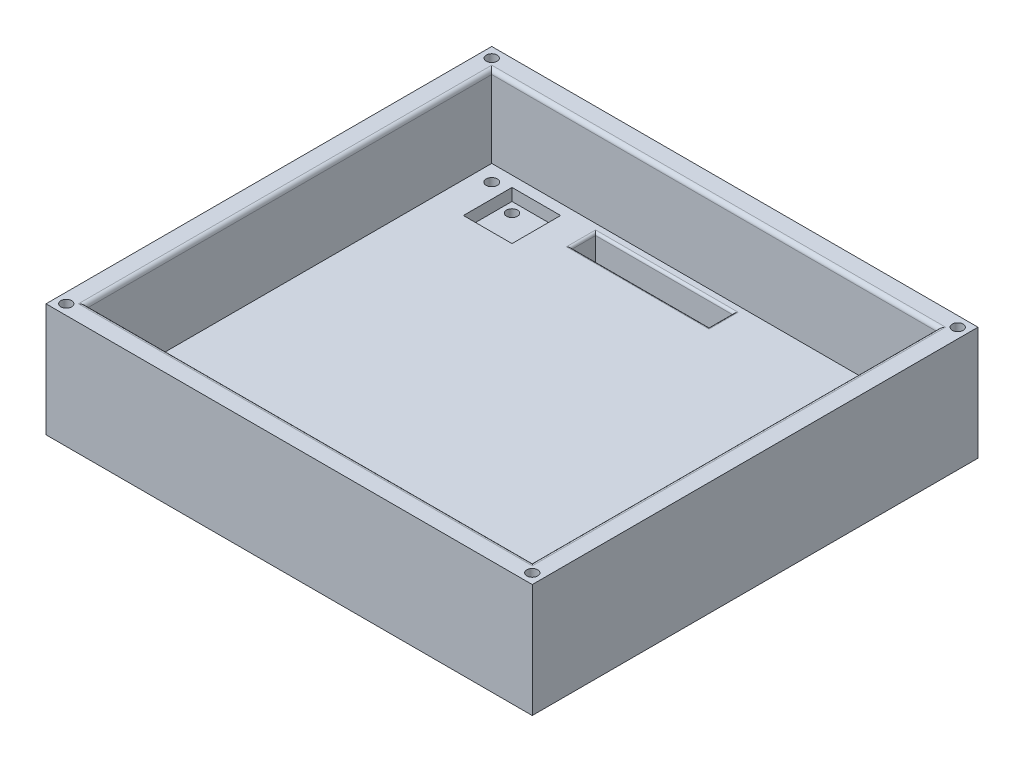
ISO-10303-21;
HEADER;
FILE_DESCRIPTION(('STEP AP214'),'2;1');
FILE_NAME('part.step','',(''),(''),'','','');
FILE_SCHEMA(('AUTOMOTIVE_DESIGN { 1 0 10303 214 1 1 1 1 }'));
ENDSEC;
DATA;
#1=APPLICATION_CONTEXT('core data for automotive mechanical design processes');
#2=APPLICATION_PROTOCOL_DEFINITION('international standard','automotive_design',2000,#1);
#3=PRODUCT_CONTEXT('',#1,'mechanical');
#4=PRODUCT('Part','Part','',(#3));
#5=PRODUCT_RELATED_PRODUCT_CATEGORY('part','',(#4));
#6=PRODUCT_DEFINITION_FORMATION('','',#4);
#7=PRODUCT_DEFINITION_CONTEXT('part definition',#1,'design');
#8=PRODUCT_DEFINITION('design','',#6,#7);
#9=PRODUCT_DEFINITION_SHAPE('','',#8);
#10=(LENGTH_UNIT() NAMED_UNIT(*) SI_UNIT(.MILLI.,.METRE.));
#11=(NAMED_UNIT(*) PLANE_ANGLE_UNIT() SI_UNIT($,.RADIAN.));
#12=(NAMED_UNIT(*) SI_UNIT($,.STERADIAN.) SOLID_ANGLE_UNIT());
#13=UNCERTAINTY_MEASURE_WITH_UNIT(LENGTH_MEASURE(1.E-05),#10,'distance_accuracy_value','');
#14=(GEOMETRIC_REPRESENTATION_CONTEXT(3) GLOBAL_UNCERTAINTY_ASSIGNED_CONTEXT((#13)) GLOBAL_UNIT_ASSIGNED_CONTEXT((#10,
#11,#12)) REPRESENTATION_CONTEXT('',''));
#15=CARTESIAN_POINT('',(0.,0.,0.));
#16=DIRECTION('',(0.,0.,1.));
#17=DIRECTION('',(1.,0.,0.));
#18=AXIS2_PLACEMENT_3D('',#15,#16,#17);
#19=CARTESIAN_POINT('',(0.,-3.81,58.8899));
#20=DIRECTION('',(0.,0.,1.));
#21=DIRECTION('',(1.,0.,0.));
#22=AXIS2_PLACEMENT_3D('',#19,#20,#21);
#23=PLANE('',#22);
#24=DIRECTION('',(-1.,0.,0.));
#25=VECTOR('',#24,1.);
#26=CARTESIAN_POINT('',(0.,-10.16,58.8899));
#27=LINE('',#26,#25);
#28=CARTESIAN_POINT('',(58.8899,-10.16,58.8899));
#29=VERTEX_POINT('',#28);
#30=CARTESIAN_POINT('',(43.6499,-10.16,58.8899));
#31=VERTEX_POINT('',#30);
#32=EDGE_CURVE('E124',#29,#31,#27,.T.);
#33=ORIENTED_EDGE('',*,*,#32,.F.);
#34=DIRECTION('',(0.,-1.,0.));
#35=VECTOR('',#34,1.);
#36=CARTESIAN_POINT('',(58.8899,-3.81,58.8899));
#37=LINE('',#36,#35);
#38=CARTESIAN_POINT('',(58.8899,-3.81,58.8899));
#39=VERTEX_POINT('',#38);
#40=EDGE_CURVE('E12',#39,#29,#37,.T.);
#41=ORIENTED_EDGE('',*,*,#40,.F.);
#42=DIRECTION('',(-1.,0.,0.));
#43=VECTOR('',#42,1.);
#44=CARTESIAN_POINT('',(0.,-3.81,58.8899));
#45=LINE('',#44,#43);
#46=CARTESIAN_POINT('',(43.6499,-3.81,58.8899));
#47=VERTEX_POINT('',#46);
#48=EDGE_CURVE('E118',#39,#47,#45,.T.);
#49=ORIENTED_EDGE('',*,*,#48,.T.);
#50=DIRECTION('',(0.,-1.,0.));
#51=VECTOR('',#50,1.);
#52=CARTESIAN_POINT('',(43.6499,-3.81,58.8899));
#53=LINE('',#52,#51);
#54=EDGE_CURVE('E61',#47,#31,#53,.T.);
#55=ORIENTED_EDGE('',*,*,#54,.T.);
#56=EDGE_LOOP('',(#33,#41,#49,#55));
#57=FACE_BOUND('',#56,.T.);
#58=ADVANCED_FACE('F58',(#57),#23,.T.);
#59=CARTESIAN_POINT('',(58.8899,-3.81,0.));
#60=DIRECTION('',(-1.,0.,0.));
#61=DIRECTION('',(0.,0.,1.));
#62=AXIS2_PLACEMENT_3D('',#59,#60,#61);
#63=PLANE('',#62);
#64=DIRECTION('',(0.,0.,-1.));
#65=VECTOR('',#64,1.);
#66=CARTESIAN_POINT('',(58.8899,-10.16,0.));
#67=LINE('',#66,#65);
#68=CARTESIAN_POINT('',(58.8899,-10.16,43.6499));
#69=VERTEX_POINT('',#68);
#70=EDGE_CURVE('E91',#29,#69,#67,.T.);
#71=ORIENTED_EDGE('',*,*,#70,.T.);
#72=DIRECTION('',(0.,-1.,0.));
#73=VECTOR('',#72,1.);
#74=CARTESIAN_POINT('',(58.8899,-3.81,43.6499));
#75=LINE('',#74,#73);
#76=CARTESIAN_POINT('',(58.8899,-3.81,43.6499));
#77=VERTEX_POINT('',#76);
#78=EDGE_CURVE('E67',#77,#69,#75,.T.);
#79=ORIENTED_EDGE('',*,*,#78,.F.);
#80=DIRECTION('',(0.,0.,-1.));
#81=VECTOR('',#80,1.);
#82=CARTESIAN_POINT('',(58.8899,-3.81,0.));
#83=LINE('',#82,#81);
#84=EDGE_CURVE('E108',#39,#77,#83,.T.);
#85=ORIENTED_EDGE('',*,*,#84,.F.);
#86=ORIENTED_EDGE('',*,*,#40,.T.);
#87=EDGE_LOOP('',(#71,#79,#85,#86));
#88=FACE_BOUND('',#87,.T.);
#89=ADVANCED_FACE('F135',(#88),#63,.F.);
#90=CARTESIAN_POINT('',(0.,-3.81,43.6499));
#91=DIRECTION('',(0.,0.,1.));
#92=DIRECTION('',(1.,0.,0.));
#93=AXIS2_PLACEMENT_3D('',#90,#91,#92);
#94=PLANE('',#93);
#95=DIRECTION('',(-1.,0.,0.));
#96=VECTOR('',#95,1.);
#97=CARTESIAN_POINT('',(0.,-10.16,43.6499));
#98=LINE('',#97,#96);
#99=CARTESIAN_POINT('',(43.6499,-10.16,43.6499));
#100=VERTEX_POINT('',#99);
#101=EDGE_CURVE('E115',#69,#100,#98,.T.);
#102=ORIENTED_EDGE('',*,*,#101,.T.);
#103=DIRECTION('',(0.,-1.,0.));
#104=VECTOR('',#103,1.);
#105=CARTESIAN_POINT('',(43.6499,-3.81,43.6499));
#106=LINE('',#105,#104);
#107=CARTESIAN_POINT('',(43.6499,-3.81,43.6499));
#108=VERTEX_POINT('',#107);
#109=EDGE_CURVE('E112',#108,#100,#106,.T.);
#110=ORIENTED_EDGE('',*,*,#109,.F.);
#111=DIRECTION('',(-1.,0.,0.));
#112=VECTOR('',#111,1.);
#113=CARTESIAN_POINT('',(0.,-3.81,43.6499));
#114=LINE('',#113,#112);
#115=EDGE_CURVE('E103',#77,#108,#114,.T.);
#116=ORIENTED_EDGE('',*,*,#115,.F.);
#117=ORIENTED_EDGE('',*,*,#78,.T.);
#118=EDGE_LOOP('',(#102,#110,#116,#117));
#119=FACE_BOUND('',#118,.T.);
#120=ADVANCED_FACE('F113',(#119),#94,.F.);
#121=CARTESIAN_POINT('',(43.6499,-3.81,0.));
#122=DIRECTION('',(-1.,0.,0.));
#123=DIRECTION('',(0.,0.,1.));
#124=AXIS2_PLACEMENT_3D('',#121,#122,#123);
#125=PLANE('',#124);
#126=DIRECTION('',(0.,0.,-1.));
#127=VECTOR('',#126,1.);
#128=CARTESIAN_POINT('',(43.6499,-10.16,0.));
#129=LINE('',#128,#127);
#130=EDGE_CURVE('E127',#31,#100,#129,.T.);
#131=ORIENTED_EDGE('',*,*,#130,.F.);
#132=ORIENTED_EDGE('',*,*,#54,.F.);
#133=DIRECTION('',(0.,0.,-1.));
#134=VECTOR('',#133,1.);
#135=CARTESIAN_POINT('',(43.6499,-3.81,0.));
#136=LINE('',#135,#134);
#137=EDGE_CURVE('E107',#47,#108,#136,.T.);
#138=ORIENTED_EDGE('',*,*,#137,.T.);
#139=ORIENTED_EDGE('',*,*,#109,.T.);
#140=EDGE_LOOP('',(#131,#132,#138,#139));
#141=FACE_BOUND('',#140,.T.);
#142=ADVANCED_FACE('F117',(#141),#125,.T.);
#143=CARTESIAN_POINT('',(0.,-3.81,0.));
#144=DIRECTION('',(0.,-1.,0.));
#145=DIRECTION('',(0.,0.,-1.));
#146=AXIS2_PLACEMENT_3D('',#143,#144,#145);
#147=PLANE('',#146);
#148=CARTESIAN_POINT('',(55.7149,-3.81,55.7149));
#149=DIRECTION('',(0.,1.,0.));
#150=DIRECTION('',(0.,0.,1.));
#151=AXIS2_PLACEMENT_3D('',#148,#149,#150);
#152=CIRCLE('',#151,1.70180000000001);
#153=CARTESIAN_POINT('',(55.7149,-3.81,57.4167));
#154=VERTEX_POINT('',#153);
#155=EDGE_CURVE('E167',#154,#154,#152,.T.);
#156=ORIENTED_EDGE('',*,*,#155,.F.);
#157=EDGE_LOOP('',(#156));
#158=FACE_BOUND('',#157,.T.);
#159=ORIENTED_EDGE('',*,*,#48,.F.);
#160=ORIENTED_EDGE('',*,*,#84,.T.);
#161=ORIENTED_EDGE('',*,*,#115,.T.);
#162=ORIENTED_EDGE('',*,*,#137,.F.);
#163=EDGE_LOOP('',(#159,#160,#161,#162));
#164=FACE_BOUND('',#163,.T.);
#165=ADVANCED_FACE('F106',(#158,#164),#147,.F.);
#166=CARTESIAN_POINT('',(0.,-10.16,0.));
#167=DIRECTION('',(0.,-1.,0.));
#168=DIRECTION('',(0.,0.,-1.));
#169=AXIS2_PLACEMENT_3D('',#166,#167,#168);
#170=PLANE('',#169);
#171=ORIENTED_EDGE('',*,*,#32,.T.);
#172=ORIENTED_EDGE('',*,*,#130,.T.);
#173=ORIENTED_EDGE('',*,*,#101,.F.);
#174=ORIENTED_EDGE('',*,*,#70,.F.);
#175=EDGE_LOOP('',(#171,#172,#173,#174));
#176=FACE_BOUND('',#175,.T.);
#177=ADVANCED_FACE('F133',(#176),#170,.T.);
#178=CARTESIAN_POINT('',(55.7149,-7.62,55.7149));
#179=DIRECTION('',(0.,1.,0.));
#180=DIRECTION('',(0.,0.,1.));
#181=AXIS2_PLACEMENT_3D('',#178,#179,#180);
#182=CYLINDRICAL_SURFACE('',#181,1.70180000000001);
#183=CARTESIAN_POINT('',(55.7149,-7.62,55.7149));
#184=DIRECTION('',(0.,1.,0.));
#185=DIRECTION('',(0.,0.,1.));
#186=AXIS2_PLACEMENT_3D('',#183,#184,#185);
#187=CIRCLE('',#186,1.70180000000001);
#188=CARTESIAN_POINT('',(55.7149,-7.62,57.4167));
#189=VERTEX_POINT('',#188);
#190=EDGE_CURVE('E128',#189,#189,#187,.T.);
#191=CARTESIAN_POINT('',(55.7149,-7.62,57.4167));
#192=CARTESIAN_POINT('',(55.7149,-7.5803125,57.4167));
#193=CARTESIAN_POINT('',(55.7149,-7.540625,57.4167));
#194=CARTESIAN_POINT('',(55.7149,-7.46125,57.4167));
#195=CARTESIAN_POINT('',(55.7149,-7.4215625,57.4167));
#196=CARTESIAN_POINT('',(55.7149,-7.3421875,57.4167));
#197=CARTESIAN_POINT('',(55.7149,-7.3025,57.4167));
#198=CARTESIAN_POINT('',(55.7149,-7.223125,57.4167));
#199=CARTESIAN_POINT('',(55.7149,-7.1834375,57.4167));
#200=CARTESIAN_POINT('',(55.7149,-7.1040625,57.4167));
#201=CARTESIAN_POINT('',(55.7149,-7.064375,57.4167));
#202=CARTESIAN_POINT('',(55.7149,-6.985,57.4167));
#203=CARTESIAN_POINT('',(55.7149,-6.9453125,57.4167));
#204=CARTESIAN_POINT('',(55.7149,-6.8659375,57.4167));
#205=CARTESIAN_POINT('',(55.7149,-6.82625,57.4167));
#206=CARTESIAN_POINT('',(55.7149,-6.746875,57.4167));
#207=CARTESIAN_POINT('',(55.7149,-6.7071875,57.4167));
#208=CARTESIAN_POINT('',(55.7149,-6.6278125,57.4167));
#209=CARTESIAN_POINT('',(55.7149,-6.588125,57.4167));
#210=CARTESIAN_POINT('',(55.7149,-6.50875,57.4167));
#211=CARTESIAN_POINT('',(55.7149,-6.4690625,57.4167));
#212=CARTESIAN_POINT('',(55.7149,-6.3896875,57.4167));
#213=CARTESIAN_POINT('',(55.7149,-6.35,57.4167));
#214=CARTESIAN_POINT('',(55.7149,-6.270625,57.4167));
#215=CARTESIAN_POINT('',(55.7149,-6.2309375,57.4167));
#216=CARTESIAN_POINT('',(55.7149,-6.1515625,57.4167));
#217=CARTESIAN_POINT('',(55.7149,-6.111875,57.4167));
#218=CARTESIAN_POINT('',(55.7149,-6.0325,57.4167));
#219=CARTESIAN_POINT('',(55.7149,-5.9928125,57.4167));
#220=CARTESIAN_POINT('',(55.7149,-5.9134375,57.4167));
#221=CARTESIAN_POINT('',(55.7149,-5.87375,57.4167));
#222=CARTESIAN_POINT('',(55.7149,-5.794375,57.4167));
#223=CARTESIAN_POINT('',(55.7149,-5.7546875,57.4167));
#224=CARTESIAN_POINT('',(55.7149,-5.6753125,57.4167));
#225=CARTESIAN_POINT('',(55.7149,-5.635625,57.4167));
#226=CARTESIAN_POINT('',(55.7149,-5.55625,57.4167));
#227=CARTESIAN_POINT('',(55.7149,-5.5165625,57.4167));
#228=CARTESIAN_POINT('',(55.7149,-5.4371875,57.4167));
#229=CARTESIAN_POINT('',(55.7149,-5.3975,57.4167));
#230=CARTESIAN_POINT('',(55.7149,-5.318125,57.4167));
#231=CARTESIAN_POINT('',(55.7149,-5.2784375,57.4167));
#232=CARTESIAN_POINT('',(55.7149,-5.1990625,57.4167));
#233=CARTESIAN_POINT('',(55.7149,-5.159375,57.4167));
#234=CARTESIAN_POINT('',(55.7149,-5.08,57.4167));
#235=CARTESIAN_POINT('',(55.7149,-5.0403125,57.4167));
#236=CARTESIAN_POINT('',(55.7149,-4.9609375,57.4167));
#237=CARTESIAN_POINT('',(55.7149,-4.92125,57.4167));
#238=CARTESIAN_POINT('',(55.7149,-4.841875,57.4167));
#239=CARTESIAN_POINT('',(55.7149,-4.8021875,57.4167));
#240=CARTESIAN_POINT('',(55.7149,-4.7228125,57.4167));
#241=CARTESIAN_POINT('',(55.7149,-4.683125,57.4167));
#242=CARTESIAN_POINT('',(55.7149,-4.60375,57.4167));
#243=CARTESIAN_POINT('',(55.7149,-4.5640625,57.4167));
#244=CARTESIAN_POINT('',(55.7149,-4.4846875,57.4167));
#245=CARTESIAN_POINT('',(55.7149,-4.445,57.4167));
#246=CARTESIAN_POINT('',(55.7149,-4.365625,57.4167));
#247=CARTESIAN_POINT('',(55.7149,-4.3259375,57.4167));
#248=CARTESIAN_POINT('',(55.7149,-4.2465625,57.4167));
#249=CARTESIAN_POINT('',(55.7149,-4.206875,57.4167));
#250=CARTESIAN_POINT('',(55.7149,-4.1275,57.4167));
#251=CARTESIAN_POINT('',(55.7149,-4.0878125,57.4167));
#252=CARTESIAN_POINT('',(55.7149,-4.0084375,57.4167));
#253=CARTESIAN_POINT('',(55.7149,-3.96875,57.4167));
#254=CARTESIAN_POINT('',(55.7149,-3.889375,57.4167));
#255=CARTESIAN_POINT('',(55.7149,-3.8496875,57.4167));
#256=CARTESIAN_POINT('',(55.7149,-3.81,57.4167));
#257=B_SPLINE_CURVE_WITH_KNOTS('',3,(#191,#192,#193,#194,#195,#196,#197,#198,#199,#200,#201,
#202,#203,#204,#205,#206,#207,#208,#209,#210,#211,#212,#213,#214,#215,#216,#217,#218,#219,#220,
#221,#222,#223,#224,#225,#226,#227,#228,#229,#230,#231,#232,#233,#234,#235,#236,#237,#238,#239,
#240,#241,#242,#243,#244,#245,#246,#247,#248,#249,#250,#251,#252,#253,#254,#255,#256),
.UNSPECIFIED.,.F.,.F.,(4,2,2,2,2,2,2,2,2,2,2,2,2,2,2,2,2,2,2,2,2,2,2,2,2,2,2,2,2,2,2,2,4),(0.,
0.119062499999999,0.238125,0.3571875,0.476249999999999,0.595312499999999,0.714375,
0.833437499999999,0.952499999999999,1.0715625,1.190625,1.3096875,1.42875,1.5478125,1.666875,
1.7859375,1.905,2.0240625,2.143125,2.2621875,2.38125,2.5003125,2.619375,2.7384375,2.8575,
2.9765625,3.095625,3.2146875,3.33375,3.4528125,3.571875,3.6909375,3.81),.UNSPECIFIED.);
#258=EDGE_CURVE('BSEAM155',#189,#154,#257,.T.);
#259=ORIENTED_EDGE('',*,*,#190,.F.);
#260=ORIENTED_EDGE('',*,*,#155,.T.);
#261=ORIENTED_EDGE('',*,*,#258,.T.);
#262=ORIENTED_EDGE('',*,*,#258,.F.);
#263=EDGE_LOOP('',(#259,#261,#260,#262));
#264=FACE_BOUND('',#263,.T.);
#265=ADVANCED_FACE('F155',(#264),#182,.F.);
#266=CARTESIAN_POINT('',(0.,-7.62,0.));
#267=DIRECTION('',(0.,1.,0.));
#268=DIRECTION('',(0.,0.,1.));
#269=AXIS2_PLACEMENT_3D('',#266,#267,#268);
#270=PLANE('',#269);
#271=ORIENTED_EDGE('',*,*,#190,.T.);
#272=EDGE_LOOP('',(#271));
#273=FACE_BOUND('',#272,.T.);
#274=ADVANCED_FACE('F159',(#273),#270,.T.);
#275=CLOSED_SHELL('',(#58,#89,#120,#142,#165,#177,#265,#274));
#276=MANIFOLD_SOLID_BREP('B2',#275);
#277=CARTESIAN_POINT('',(0.,-3.81,-60.1599));
#278=DIRECTION('',(0.,0.,-1.));
#279=DIRECTION('',(-1.,0.,0.));
#280=AXIS2_PLACEMENT_3D('',#277,#278,#279);
#281=PLANE('',#280);
#282=DIRECTION('',(1.,0.,0.));
#283=VECTOR('',#282,1.);
#284=CARTESIAN_POINT('',(0.,-10.16,-60.1599));
#285=LINE('',#284,#283);
#286=CARTESIAN_POINT('',(-60.1599,-10.16,-60.1599));
#287=VERTEX_POINT('',#286);
#288=CARTESIAN_POINT('',(-44.9199,-10.16,-60.1599));
#289=VERTEX_POINT('',#288);
#290=EDGE_CURVE('E287',#287,#289,#285,.T.);
#291=ORIENTED_EDGE('',*,*,#290,.F.);
#292=DIRECTION('',(0.,-1.,0.));
#293=VECTOR('',#292,1.);
#294=CARTESIAN_POINT('',(-60.1599,-3.81,-60.1599));
#295=LINE('',#294,#293);
#296=CARTESIAN_POINT('',(-60.1599,-3.81,-60.1599));
#297=VERTEX_POINT('',#296);
#298=EDGE_CURVE('E56',#297,#287,#295,.T.);
#299=ORIENTED_EDGE('',*,*,#298,.F.);
#300=DIRECTION('',(1.,0.,0.));
#301=VECTOR('',#300,1.);
#302=CARTESIAN_POINT('',(0.,-3.81,-60.1599));
#303=LINE('',#302,#301);
#304=CARTESIAN_POINT('',(-44.9199,-3.81,-60.1599));
#305=VERTEX_POINT('',#304);
#306=EDGE_CURVE('E281',#297,#305,#303,.T.);
#307=ORIENTED_EDGE('',*,*,#306,.T.);
#308=DIRECTION('',(0.,-1.,0.));
#309=VECTOR('',#308,1.);
#310=CARTESIAN_POINT('',(-44.9199,-3.81,-60.1599));
#311=LINE('',#310,#309);
#312=EDGE_CURVE('E224',#305,#289,#311,.T.);
#313=ORIENTED_EDGE('',*,*,#312,.T.);
#314=EDGE_LOOP('',(#291,#299,#307,#313));
#315=FACE_BOUND('',#314,.T.);
#316=ADVANCED_FACE('F221',(#315),#281,.T.);
#317=CARTESIAN_POINT('',(-60.1599,-3.81,0.));
#318=DIRECTION('',(1.,0.,0.));
#319=DIRECTION('',(0.,0.,-1.));
#320=AXIS2_PLACEMENT_3D('',#317,#318,#319);
#321=PLANE('',#320);
#322=DIRECTION('',(0.,0.,1.));
#323=VECTOR('',#322,1.);
#324=CARTESIAN_POINT('',(-60.1599,-10.16,0.));
#325=LINE('',#324,#323);
#326=CARTESIAN_POINT('',(-60.1599,-10.16,-44.9199));
#327=VERTEX_POINT('',#326);
#328=EDGE_CURVE('E254',#287,#327,#325,.T.);
#329=ORIENTED_EDGE('',*,*,#328,.T.);
#330=DIRECTION('',(0.,-1.,0.));
#331=VECTOR('',#330,1.);
#332=CARTESIAN_POINT('',(-60.1599,-3.81,-44.9199));
#333=LINE('',#332,#331);
#334=CARTESIAN_POINT('',(-60.1599,-3.81,-44.9199));
#335=VERTEX_POINT('',#334);
#336=EDGE_CURVE('E230',#335,#327,#333,.T.);
#337=ORIENTED_EDGE('',*,*,#336,.F.);
#338=DIRECTION('',(0.,0.,1.));
#339=VECTOR('',#338,1.);
#340=CARTESIAN_POINT('',(-60.1599,-3.81,0.));
#341=LINE('',#340,#339);
#342=EDGE_CURVE('E271',#297,#335,#341,.T.);
#343=ORIENTED_EDGE('',*,*,#342,.F.);
#344=ORIENTED_EDGE('',*,*,#298,.T.);
#345=EDGE_LOOP('',(#329,#337,#343,#344));
#346=FACE_BOUND('',#345,.T.);
#347=ADVANCED_FACE('F298',(#346),#321,.F.);
#348=CARTESIAN_POINT('',(0.,-3.81,-44.9199));
#349=DIRECTION('',(0.,0.,-1.));
#350=DIRECTION('',(-1.,0.,0.));
#351=AXIS2_PLACEMENT_3D('',#348,#349,#350);
#352=PLANE('',#351);
#353=DIRECTION('',(1.,0.,0.));
#354=VECTOR('',#353,1.);
#355=CARTESIAN_POINT('',(0.,-10.16,-44.9199));
#356=LINE('',#355,#354);
#357=CARTESIAN_POINT('',(-44.9199,-10.16,-44.9199));
#358=VERTEX_POINT('',#357);
#359=EDGE_CURVE('E278',#327,#358,#356,.T.);
#360=ORIENTED_EDGE('',*,*,#359,.T.);
#361=DIRECTION('',(0.,-1.,0.));
#362=VECTOR('',#361,1.);
#363=CARTESIAN_POINT('',(-44.9199,-3.81,-44.9199));
#364=LINE('',#363,#362);
#365=CARTESIAN_POINT('',(-44.9199,-3.81,-44.9199));
#366=VERTEX_POINT('',#365);
#367=EDGE_CURVE('E275',#366,#358,#364,.T.);
#368=ORIENTED_EDGE('',*,*,#367,.F.);
#369=DIRECTION('',(1.,0.,0.));
#370=VECTOR('',#369,1.);
#371=CARTESIAN_POINT('',(0.,-3.81,-44.9199));
#372=LINE('',#371,#370);
#373=EDGE_CURVE('E266',#335,#366,#372,.T.);
#374=ORIENTED_EDGE('',*,*,#373,.F.);
#375=ORIENTED_EDGE('',*,*,#336,.T.);
#376=EDGE_LOOP('',(#360,#368,#374,#375));
#377=FACE_BOUND('',#376,.T.);
#378=ADVANCED_FACE('F276',(#377),#352,.F.);
#379=CARTESIAN_POINT('',(-44.9199,-3.81,0.));
#380=DIRECTION('',(1.,0.,0.));
#381=DIRECTION('',(0.,0.,-1.));
#382=AXIS2_PLACEMENT_3D('',#379,#380,#381);
#383=PLANE('',#382);
#384=DIRECTION('',(0.,0.,1.));
#385=VECTOR('',#384,1.);
#386=CARTESIAN_POINT('',(-44.9199,-10.16,0.));
#387=LINE('',#386,#385);
#388=EDGE_CURVE('E290',#289,#358,#387,.T.);
#389=ORIENTED_EDGE('',*,*,#388,.F.);
#390=ORIENTED_EDGE('',*,*,#312,.F.);
#391=DIRECTION('',(0.,0.,1.));
#392=VECTOR('',#391,1.);
#393=CARTESIAN_POINT('',(-44.9199,-3.81,0.));
#394=LINE('',#393,#392);
#395=EDGE_CURVE('E270',#305,#366,#394,.T.);
#396=ORIENTED_EDGE('',*,*,#395,.T.);
#397=ORIENTED_EDGE('',*,*,#367,.T.);
#398=EDGE_LOOP('',(#389,#390,#396,#397));
#399=FACE_BOUND('',#398,.T.);
#400=ADVANCED_FACE('F280',(#399),#383,.T.);
#401=CARTESIAN_POINT('',(0.,-3.81,0.));
#402=DIRECTION('',(0.,-1.,0.));
#403=DIRECTION('',(0.,0.,-1.));
#404=AXIS2_PLACEMENT_3D('',#401,#402,#403);
#405=PLANE('',#404);
#406=CARTESIAN_POINT('',(-56.9849,-3.81,-56.9849));
#407=DIRECTION('',(0.,1.,0.));
#408=DIRECTION('',(0.,0.,1.));
#409=AXIS2_PLACEMENT_3D('',#406,#407,#408);
#410=CIRCLE('',#409,1.70180000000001);
#411=CARTESIAN_POINT('',(-56.9849,-3.81,-55.2831));
#412=VERTEX_POINT('',#411);
#413=EDGE_CURVE('E330',#412,#412,#410,.T.);
#414=ORIENTED_EDGE('',*,*,#413,.F.);
#415=EDGE_LOOP('',(#414));
#416=FACE_BOUND('',#415,.T.);
#417=ORIENTED_EDGE('',*,*,#306,.F.);
#418=ORIENTED_EDGE('',*,*,#342,.T.);
#419=ORIENTED_EDGE('',*,*,#373,.T.);
#420=ORIENTED_EDGE('',*,*,#395,.F.);
#421=EDGE_LOOP('',(#417,#418,#419,#420));
#422=FACE_BOUND('',#421,.T.);
#423=ADVANCED_FACE('F269',(#416,#422),#405,.F.);
#424=CARTESIAN_POINT('',(0.,-10.16,0.));
#425=DIRECTION('',(0.,-1.,0.));
#426=DIRECTION('',(0.,0.,-1.));
#427=AXIS2_PLACEMENT_3D('',#424,#425,#426);
#428=PLANE('',#427);
#429=ORIENTED_EDGE('',*,*,#290,.T.);
#430=ORIENTED_EDGE('',*,*,#388,.T.);
#431=ORIENTED_EDGE('',*,*,#359,.F.);
#432=ORIENTED_EDGE('',*,*,#328,.F.);
#433=EDGE_LOOP('',(#429,#430,#431,#432));
#434=FACE_BOUND('',#433,.T.);
#435=ADVANCED_FACE('F296',(#434),#428,.T.);
#436=CARTESIAN_POINT('',(-56.9849,-7.62,-56.9849));
#437=DIRECTION('',(0.,1.,0.));
#438=DIRECTION('',(0.,0.,1.));
#439=AXIS2_PLACEMENT_3D('',#436,#437,#438);
#440=CYLINDRICAL_SURFACE('',#439,1.70180000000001);
#441=CARTESIAN_POINT('',(-56.9849,-7.62,-56.9849));
#442=DIRECTION('',(0.,1.,0.));
#443=DIRECTION('',(0.,0.,1.));
#444=AXIS2_PLACEMENT_3D('',#441,#442,#443);
#445=CIRCLE('',#444,1.70180000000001);
#446=CARTESIAN_POINT('',(-56.9849,-7.62,-55.2831));
#447=VERTEX_POINT('',#446);
#448=EDGE_CURVE('E291',#447,#447,#445,.T.);
#449=CARTESIAN_POINT('',(-56.9849,-7.62,-55.2831));
#450=CARTESIAN_POINT('',(-56.9849,-7.5803125,-55.2831));
#451=CARTESIAN_POINT('',(-56.9849,-7.540625,-55.2831));
#452=CARTESIAN_POINT('',(-56.9849,-7.46125,-55.2831));
#453=CARTESIAN_POINT('',(-56.9849,-7.4215625,-55.2831));
#454=CARTESIAN_POINT('',(-56.9849,-7.3421875,-55.2831));
#455=CARTESIAN_POINT('',(-56.9849,-7.3025,-55.2831));
#456=CARTESIAN_POINT('',(-56.9849,-7.223125,-55.2831));
#457=CARTESIAN_POINT('',(-56.9849,-7.1834375,-55.2831));
#458=CARTESIAN_POINT('',(-56.9849,-7.1040625,-55.2831));
#459=CARTESIAN_POINT('',(-56.9849,-7.064375,-55.2831));
#460=CARTESIAN_POINT('',(-56.9849,-6.985,-55.2831));
#461=CARTESIAN_POINT('',(-56.9849,-6.9453125,-55.2831));
#462=CARTESIAN_POINT('',(-56.9849,-6.8659375,-55.2831));
#463=CARTESIAN_POINT('',(-56.9849,-6.82625,-55.2831));
#464=CARTESIAN_POINT('',(-56.9849,-6.746875,-55.2831));
#465=CARTESIAN_POINT('',(-56.9849,-6.7071875,-55.2831));
#466=CARTESIAN_POINT('',(-56.9849,-6.6278125,-55.2831));
#467=CARTESIAN_POINT('',(-56.9849,-6.588125,-55.2831));
#468=CARTESIAN_POINT('',(-56.9849,-6.50875,-55.2831));
#469=CARTESIAN_POINT('',(-56.9849,-6.4690625,-55.2831));
#470=CARTESIAN_POINT('',(-56.9849,-6.3896875,-55.2831));
#471=CARTESIAN_POINT('',(-56.9849,-6.35,-55.2831));
#472=CARTESIAN_POINT('',(-56.9849,-6.270625,-55.2831));
#473=CARTESIAN_POINT('',(-56.9849,-6.2309375,-55.2831));
#474=CARTESIAN_POINT('',(-56.9849,-6.1515625,-55.2831));
#475=CARTESIAN_POINT('',(-56.9849,-6.111875,-55.2831));
#476=CARTESIAN_POINT('',(-56.9849,-6.0325,-55.2831));
#477=CARTESIAN_POINT('',(-56.9849,-5.9928125,-55.2831));
#478=CARTESIAN_POINT('',(-56.9849,-5.9134375,-55.2831));
#479=CARTESIAN_POINT('',(-56.9849,-5.87375,-55.2831));
#480=CARTESIAN_POINT('',(-56.9849,-5.794375,-55.2831));
#481=CARTESIAN_POINT('',(-56.9849,-5.7546875,-55.2831));
#482=CARTESIAN_POINT('',(-56.9849,-5.6753125,-55.2831));
#483=CARTESIAN_POINT('',(-56.9849,-5.635625,-55.2831));
#484=CARTESIAN_POINT('',(-56.9849,-5.55625,-55.2831));
#485=CARTESIAN_POINT('',(-56.9849,-5.5165625,-55.2831));
#486=CARTESIAN_POINT('',(-56.9849,-5.4371875,-55.2831));
#487=CARTESIAN_POINT('',(-56.9849,-5.3975,-55.2831));
#488=CARTESIAN_POINT('',(-56.9849,-5.318125,-55.2831));
#489=CARTESIAN_POINT('',(-56.9849,-5.2784375,-55.2831));
#490=CARTESIAN_POINT('',(-56.9849,-5.1990625,-55.2831));
#491=CARTESIAN_POINT('',(-56.9849,-5.159375,-55.2831));
#492=CARTESIAN_POINT('',(-56.9849,-5.08,-55.2831));
#493=CARTESIAN_POINT('',(-56.9849,-5.0403125,-55.2831));
#494=CARTESIAN_POINT('',(-56.9849,-4.9609375,-55.2831));
#495=CARTESIAN_POINT('',(-56.9849,-4.92125,-55.2831));
#496=CARTESIAN_POINT('',(-56.9849,-4.841875,-55.2831));
#497=CARTESIAN_POINT('',(-56.9849,-4.8021875,-55.2831));
#498=CARTESIAN_POINT('',(-56.9849,-4.7228125,-55.2831));
#499=CARTESIAN_POINT('',(-56.9849,-4.683125,-55.2831));
#500=CARTESIAN_POINT('',(-56.9849,-4.60375,-55.2831));
#501=CARTESIAN_POINT('',(-56.9849,-4.5640625,-55.2831));
#502=CARTESIAN_POINT('',(-56.9849,-4.4846875,-55.2831));
#503=CARTESIAN_POINT('',(-56.9849,-4.445,-55.2831));
#504=CARTESIAN_POINT('',(-56.9849,-4.365625,-55.2831));
#505=CARTESIAN_POINT('',(-56.9849,-4.3259375,-55.2831));
#506=CARTESIAN_POINT('',(-56.9849,-4.2465625,-55.2831));
#507=CARTESIAN_POINT('',(-56.9849,-4.206875,-55.2831));
#508=CARTESIAN_POINT('',(-56.9849,-4.1275,-55.2831));
#509=CARTESIAN_POINT('',(-56.9849,-4.0878125,-55.2831));
#510=CARTESIAN_POINT('',(-56.9849,-4.0084375,-55.2831));
#511=CARTESIAN_POINT('',(-56.9849,-3.96875,-55.2831));
#512=CARTESIAN_POINT('',(-56.9849,-3.889375,-55.2831));
#513=CARTESIAN_POINT('',(-56.9849,-3.8496875,-55.2831));
#514=CARTESIAN_POINT('',(-56.9849,-3.81,-55.2831));
#515=B_SPLINE_CURVE_WITH_KNOTS('',3,(#449,#450,#451,#452,#453,#454,#455,#456,#457,#458,#459,
#460,#461,#462,#463,#464,#465,#466,#467,#468,#469,#470,#471,#472,#473,#474,#475,#476,#477,#478,
#479,#480,#481,#482,#483,#484,#485,#486,#487,#488,#489,#490,#491,#492,#493,#494,#495,#496,#497,
#498,#499,#500,#501,#502,#503,#504,#505,#506,#507,#508,#509,#510,#511,#512,#513,#514),
.UNSPECIFIED.,.F.,.F.,(4,2,2,2,2,2,2,2,2,2,2,2,2,2,2,2,2,2,2,2,2,2,2,2,2,2,2,2,2,2,2,2,4),(0.,
0.119062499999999,0.238125,0.3571875,0.476249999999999,0.595312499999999,0.714375,
0.833437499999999,0.952499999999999,1.0715625,1.190625,1.3096875,1.42875,1.5478125,1.666875,
1.7859375,1.905,2.0240625,2.143125,2.2621875,2.38125,2.5003125,2.619375,2.7384375,2.8575,
2.9765625,3.095625,3.2146875,3.33375,3.4528125,3.571875,3.6909375,3.81),.UNSPECIFIED.);
#516=EDGE_CURVE('BSEAM318',#447,#412,#515,.T.);
#517=ORIENTED_EDGE('',*,*,#448,.F.);
#518=ORIENTED_EDGE('',*,*,#413,.T.);
#519=ORIENTED_EDGE('',*,*,#516,.T.);
#520=ORIENTED_EDGE('',*,*,#516,.F.);
#521=EDGE_LOOP('',(#517,#519,#518,#520));
#522=FACE_BOUND('',#521,.T.);
#523=ADVANCED_FACE('F318',(#522),#440,.F.);
#524=CARTESIAN_POINT('',(0.,-7.62,0.));
#525=DIRECTION('',(0.,1.,0.));
#526=DIRECTION('',(0.,0.,1.));
#527=AXIS2_PLACEMENT_3D('',#524,#525,#526);
#528=PLANE('',#527);
#529=ORIENTED_EDGE('',*,*,#448,.T.);
#530=EDGE_LOOP('',(#529));
#531=FACE_BOUND('',#530,.T.);
#532=ADVANCED_FACE('F322',(#531),#528,.T.);
#533=CLOSED_SHELL('',(#316,#347,#378,#400,#423,#435,#523,#532));
#534=MANIFOLD_SOLID_BREP('B6',#533);
#535=CARTESIAN_POINT('',(0.,0.,0.));
#536=DIRECTION('',(0.,-1.,0.));
#537=DIRECTION('',(0.,0.,-1.));
#538=AXIS2_PLACEMENT_3D('',#535,#536,#537);
#539=PLANE('',#538);
#540=CARTESIAN_POINT('',(-64.7700000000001,0.,58.42));
#541=DIRECTION('',(0.,1.,0.));
#542=DIRECTION('',(0.,0.,1.));
#543=AXIS2_PLACEMENT_3D('',#540,#541,#542);
#544=CIRCLE('',#543,1.76529999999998);
#545=CARTESIAN_POINT('',(-64.7700000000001,0.,60.1853));
#546=VERTEX_POINT('',#545);
#547=EDGE_CURVE('E1333',#546,#546,#544,.T.);
#548=ORIENTED_EDGE('',*,*,#547,.F.);
#549=EDGE_LOOP('',(#548));
#550=FACE_BOUND('',#549,.T.);
#551=CARTESIAN_POINT('',(64.77,0.,58.42));
#552=DIRECTION('',(0.,1.,0.));
#553=DIRECTION('',(0.,0.,1.));
#554=AXIS2_PLACEMENT_3D('',#551,#552,#553);
#555=CIRCLE('',#554,1.76529999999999);
#556=CARTESIAN_POINT('',(64.77,0.,60.1853));
#557=VERTEX_POINT('',#556);
#558=EDGE_CURVE('E1337',#557,#557,#555,.T.);
#559=ORIENTED_EDGE('',*,*,#558,.F.);
#560=EDGE_LOOP('',(#559));
#561=FACE_BOUND('',#560,.T.);
#562=CARTESIAN_POINT('',(64.77,0.,-58.42));
#563=DIRECTION('',(0.,1.,0.));
#564=DIRECTION('',(0.,0.,1.));
#565=AXIS2_PLACEMENT_3D('',#562,#563,#564);
#566=CIRCLE('',#565,1.76529999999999);
#567=CARTESIAN_POINT('',(64.77,0.,-56.6547));
#568=VERTEX_POINT('',#567);
#569=EDGE_CURVE('E1351',#568,#568,#566,.T.);
#570=ORIENTED_EDGE('',*,*,#569,.F.);
#571=EDGE_LOOP('',(#570));
#572=FACE_BOUND('',#571,.T.);
#573=CARTESIAN_POINT('',(-64.7700000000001,0.,-58.42));
#574=DIRECTION('',(0.,1.,0.));
#575=DIRECTION('',(0.,0.,1.));
#576=AXIS2_PLACEMENT_3D('',#573,#574,#575);
#577=CIRCLE('',#576,1.76529999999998);
#578=CARTESIAN_POINT('',(-64.7700000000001,0.,-56.6547));
#579=VERTEX_POINT('',#578);
#580=EDGE_CURVE('E573',#579,#579,#577,.T.);
#581=ORIENTED_EDGE('',*,*,#580,.F.);
#582=EDGE_LOOP('',(#581));
#583=FACE_BOUND('',#582,.T.);
#584=DIRECTION('',(-1.,0.,0.));
#585=VECTOR('',#584,1.);
#586=CARTESIAN_POINT('',(0.,0.,-61.722));
#587=LINE('',#586,#585);
#588=CARTESIAN_POINT('',(-35.5219,0.,-61.722));
#589=VERTEX_POINT('',#588);
#590=CARTESIAN_POINT('',(9.18209999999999,0.,-61.722));
#591=VERTEX_POINT('',#590);
#592=EDGE_CURVE('E785',#589,#591,#587,.F.);
#593=ORIENTED_EDGE('',*,*,#592,.T.);
#594=DIRECTION('',(0.,0.,-1.));
#595=VECTOR('',#594,1.);
#596=CARTESIAN_POINT('',(9.18209999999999,0.,0.));
#597=LINE('',#596,#595);
#598=CARTESIAN_POINT('',(9.18209999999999,0.,-52.578));
#599=VERTEX_POINT('',#598);
#600=EDGE_CURVE('E794',#591,#599,#597,.F.);
#601=ORIENTED_EDGE('',*,*,#600,.T.);
#602=DIRECTION('',(1.,0.,0.));
#603=VECTOR('',#602,1.);
#604=CARTESIAN_POINT('',(0.,0.,-52.578));
#605=LINE('',#604,#603);
#606=CARTESIAN_POINT('',(-35.5219,0.,-52.578));
#607=VERTEX_POINT('',#606);
#608=EDGE_CURVE('E791',#599,#607,#605,.F.);
#609=ORIENTED_EDGE('',*,*,#608,.T.);
#610=DIRECTION('',(0.,0.,1.));
#611=VECTOR('',#610,1.);
#612=CARTESIAN_POINT('',(-35.5219,0.,0.));
#613=LINE('',#612,#611);
#614=EDGE_CURVE('E788',#607,#589,#613,.F.);
#615=ORIENTED_EDGE('',*,*,#614,.T.);
#616=EDGE_LOOP('',(#593,#601,#609,#615));
#617=FACE_BOUND('',#616,.T.);
#618=DIRECTION('',(-1.,0.,0.));
#619=VECTOR('',#618,1.);
#620=CARTESIAN_POINT('',(-44.9199,0.,-60.1599));
#621=LINE('',#620,#619);
#622=CARTESIAN_POINT('',(-44.9199,0.,-60.1599));
#623=VERTEX_POINT('',#622);
#624=CARTESIAN_POINT('',(-60.1599,0.,-60.1599));
#625=VERTEX_POINT('',#624);
#626=EDGE_CURVE('E730',#623,#625,#621,.T.);
#627=ORIENTED_EDGE('',*,*,#626,.F.);
#628=DIRECTION('',(0.,0.,-1.));
#629=VECTOR('',#628,1.);
#630=CARTESIAN_POINT('',(-44.9199,0.,-44.9199));
#631=LINE('',#630,#629);
#632=CARTESIAN_POINT('',(-44.9199,0.,-44.9199));
#633=VERTEX_POINT('',#632);
#634=EDGE_CURVE('E700',#633,#623,#631,.T.);
#635=ORIENTED_EDGE('',*,*,#634,.F.);
#636=DIRECTION('',(1.,0.,0.));
#637=VECTOR('',#636,1.);
#638=CARTESIAN_POINT('',(-44.9199,0.,-44.9199));
#639=LINE('',#638,#637);
#640=CARTESIAN_POINT('',(-60.1599,0.,-44.9199));
#641=VERTEX_POINT('',#640);
#642=EDGE_CURVE('E715',#641,#633,#639,.T.);
#643=ORIENTED_EDGE('',*,*,#642,.F.);
#644=DIRECTION('',(0.,0.,1.));
#645=VECTOR('',#644,1.);
#646=CARTESIAN_POINT('',(-60.1599,0.,-44.9199));
#647=LINE('',#646,#645);
#648=EDGE_CURVE('E734',#625,#641,#647,.T.);
#649=ORIENTED_EDGE('',*,*,#648,.F.);
#650=EDGE_LOOP('',(#627,#635,#643,#649));
#651=FACE_BOUND('',#650,.T.);
#652=DIRECTION('',(1.,0.,0.));
#653=VECTOR('',#652,1.);
#654=CARTESIAN_POINT('',(43.6499,0.,58.8899));
#655=LINE('',#654,#653);
#656=CARTESIAN_POINT('',(43.6499,0.,58.8899));
#657=VERTEX_POINT('',#656);
#658=CARTESIAN_POINT('',(58.8899,0.,58.8899));
#659=VERTEX_POINT('',#658);
#660=EDGE_CURVE('E686',#657,#659,#655,.T.);
#661=ORIENTED_EDGE('',*,*,#660,.F.);
#662=DIRECTION('',(0.,0.,1.));
#663=VECTOR('',#662,1.);
#664=CARTESIAN_POINT('',(43.6499,0.,43.6499));
#665=LINE('',#664,#663);
#666=CARTESIAN_POINT('',(43.6499,0.,43.6499));
#667=VERTEX_POINT('',#666);
#668=EDGE_CURVE('E665',#667,#657,#665,.T.);
#669=ORIENTED_EDGE('',*,*,#668,.F.);
#670=DIRECTION('',(-1.,0.,0.));
#671=VECTOR('',#670,1.);
#672=CARTESIAN_POINT('',(43.6499,0.,43.6499));
#673=LINE('',#672,#671);
#674=CARTESIAN_POINT('',(58.8899,0.,43.6499));
#675=VERTEX_POINT('',#674);
#676=EDGE_CURVE('E671',#675,#667,#673,.T.);
#677=ORIENTED_EDGE('',*,*,#676,.F.);
#678=DIRECTION('',(0.,0.,-1.));
#679=VECTOR('',#678,1.);
#680=CARTESIAN_POINT('',(58.8899,0.,43.6499));
#681=LINE('',#680,#679);
#682=EDGE_CURVE('E690',#659,#675,#681,.T.);
#683=ORIENTED_EDGE('',*,*,#682,.F.);
#684=EDGE_LOOP('',(#661,#669,#677,#683));
#685=FACE_BOUND('',#684,.T.);
#686=DIRECTION('',(1.,0.,0.));
#687=VECTOR('',#686,1.);
#688=CARTESIAN_POINT('',(0.,0.,-63.5));
#689=LINE('',#688,#687);
#690=CARTESIAN_POINT('',(-69.8500000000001,0.,-63.5));
#691=VERTEX_POINT('',#690);
#692=CARTESIAN_POINT('',(69.85,0.,-63.5));
#693=VERTEX_POINT('',#692);
#694=EDGE_CURVE('E618',#691,#693,#689,.T.);
#695=ORIENTED_EDGE('',*,*,#694,.F.);
#696=DIRECTION('',(0.,0.,1.));
#697=VECTOR('',#696,1.);
#698=CARTESIAN_POINT('',(-69.8500000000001,0.,0.));
#699=LINE('',#698,#697);
#700=CARTESIAN_POINT('',(-69.8500000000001,0.,63.5));
#701=VERTEX_POINT('',#700);
#702=EDGE_CURVE('E627',#691,#701,#699,.T.);
#703=ORIENTED_EDGE('',*,*,#702,.T.);
#704=DIRECTION('',(1.,0.,0.));
#705=VECTOR('',#704,1.);
#706=CARTESIAN_POINT('',(0.,0.,63.5));
#707=LINE('',#706,#705);
#708=CARTESIAN_POINT('',(69.85,0.,63.5));
#709=VERTEX_POINT('',#708);
#710=EDGE_CURVE('E647',#701,#709,#707,.T.);
#711=ORIENTED_EDGE('',*,*,#710,.T.);
#712=DIRECTION('',(0.,0.,1.));
#713=VECTOR('',#712,1.);
#714=CARTESIAN_POINT('',(69.85,0.,0.));
#715=LINE('',#714,#713);
#716=EDGE_CURVE('E643',#693,#709,#715,.T.);
#717=ORIENTED_EDGE('',*,*,#716,.F.);
#718=EDGE_LOOP('',(#695,#703,#711,#717));
#719=FACE_BOUND('',#718,.T.);
#720=ADVANCED_FACE('F375',(#550,#561,#572,#583,#617,#651,#685,#719),#539,.F.);
#721=CARTESIAN_POINT('',(76.2,-10.16,69.85));
#722=DIRECTION('',(1.,0.,0.));
#723=DIRECTION('',(0.,0.,-1.));
#724=AXIS2_PLACEMENT_3D('',#721,#722,#723);
#725=PLANE('',#724);
#726=DIRECTION('',(0.,1.,0.));
#727=VECTOR('',#726,1.);
#728=CARTESIAN_POINT('',(76.2,-10.16,-69.85));
#729=LINE('',#728,#727);
#730=CARTESIAN_POINT('',(76.2,-10.16,-69.85));
#731=VERTEX_POINT('',#730);
#732=CARTESIAN_POINT('',(76.1999999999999,25.4,-69.85));
#733=VERTEX_POINT('',#732);
#734=EDGE_CURVE('E769',#731,#733,#729,.T.);
#735=ORIENTED_EDGE('',*,*,#734,.T.);
#736=DIRECTION('',(0.,0.,-1.));
#737=VECTOR('',#736,1.);
#738=CARTESIAN_POINT('',(76.2,25.4,0.));
#739=LINE('',#738,#737);
#740=CARTESIAN_POINT('',(76.1999999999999,25.4,69.85));
#741=VERTEX_POINT('',#740);
#742=EDGE_CURVE('E626',#741,#733,#739,.T.);
#743=ORIENTED_EDGE('',*,*,#742,.F.);
#744=DIRECTION('',(0.,1.,0.));
#745=VECTOR('',#744,1.);
#746=CARTESIAN_POINT('',(76.2,-10.16,69.85));
#747=LINE('',#746,#745);
#748=CARTESIAN_POINT('',(76.2,-10.16,69.85));
#749=VERTEX_POINT('',#748);
#750=EDGE_CURVE('E770',#749,#741,#747,.T.);
#751=ORIENTED_EDGE('',*,*,#750,.F.);
#752=DIRECTION('',(0.,0.,-1.));
#753=VECTOR('',#752,1.);
#754=CARTESIAN_POINT('',(76.2,-10.16,69.85));
#755=LINE('',#754,#753);
#756=EDGE_CURVE('E744',#749,#731,#755,.T.);
#757=ORIENTED_EDGE('',*,*,#756,.T.);
#758=EDGE_LOOP('',(#735,#743,#751,#757));
#759=FACE_BOUND('',#758,.T.);
#760=ADVANCED_FACE('F890',(#759),#725,.T.);
#761=CARTESIAN_POINT('',(-76.2,-10.16,69.85));
#762=DIRECTION('',(0.,0.,1.));
#763=DIRECTION('',(1.,0.,0.));
#764=AXIS2_PLACEMENT_3D('',#761,#762,#763);
#765=PLANE('',#764);
#766=ORIENTED_EDGE('',*,*,#750,.T.);
#767=DIRECTION('',(1.,0.,0.));
#768=VECTOR('',#767,1.);
#769=CARTESIAN_POINT('',(0.,25.4,69.85));
#770=LINE('',#769,#768);
#771=CARTESIAN_POINT('',(-76.2,25.4,69.85));
#772=VERTEX_POINT('',#771);
#773=EDGE_CURVE('E622',#772,#741,#770,.T.);
#774=ORIENTED_EDGE('',*,*,#773,.F.);
#775=DIRECTION('',(0.,1.,0.));
#776=VECTOR('',#775,1.);
#777=CARTESIAN_POINT('',(-76.2,-10.16,69.85));
#778=LINE('',#777,#776);
#779=CARTESIAN_POINT('',(-76.2,-10.16,69.85));
#780=VERTEX_POINT('',#779);
#781=EDGE_CURVE('E774',#780,#772,#778,.T.);
#782=ORIENTED_EDGE('',*,*,#781,.F.);
#783=DIRECTION('',(1.,0.,0.));
#784=VECTOR('',#783,1.);
#785=CARTESIAN_POINT('',(-76.2,-10.16,69.85));
#786=LINE('',#785,#784);
#787=EDGE_CURVE('E765',#780,#749,#786,.T.);
#788=ORIENTED_EDGE('',*,*,#787,.T.);
#789=EDGE_LOOP('',(#766,#774,#782,#788));
#790=FACE_BOUND('',#789,.T.);
#791=ADVANCED_FACE('F898',(#790),#765,.T.);
#792=CARTESIAN_POINT('',(-76.2,-10.16,69.85));
#793=DIRECTION('',(-1.,0.,0.));
#794=DIRECTION('',(0.,0.,1.));
#795=AXIS2_PLACEMENT_3D('',#792,#793,#794);
#796=PLANE('',#795);
#797=ORIENTED_EDGE('',*,*,#781,.T.);
#798=DIRECTION('',(0.,0.,1.));
#799=VECTOR('',#798,1.);
#800=CARTESIAN_POINT('',(-76.2,25.4,0.));
#801=LINE('',#800,#799);
#802=CARTESIAN_POINT('',(-76.2,25.4,-69.85));
#803=VERTEX_POINT('',#802);
#804=EDGE_CURVE('E635',#803,#772,#801,.T.);
#805=ORIENTED_EDGE('',*,*,#804,.F.);
#806=DIRECTION('',(0.,1.,0.));
#807=VECTOR('',#806,1.);
#808=CARTESIAN_POINT('',(-76.2,-10.16,-69.85));
#809=LINE('',#808,#807);
#810=CARTESIAN_POINT('',(-76.2,-10.16,-69.85));
#811=VERTEX_POINT('',#810);
#812=EDGE_CURVE('E777',#811,#803,#809,.T.);
#813=ORIENTED_EDGE('',*,*,#812,.F.);
#814=DIRECTION('',(0.,0.,1.));
#815=VECTOR('',#814,1.);
#816=CARTESIAN_POINT('',(-76.2,-10.16,69.85));
#817=LINE('',#816,#815);
#818=EDGE_CURVE('E761',#811,#780,#817,.T.);
#819=ORIENTED_EDGE('',*,*,#818,.T.);
#820=EDGE_LOOP('',(#797,#805,#813,#819));
#821=FACE_BOUND('',#820,.T.);
#822=ADVANCED_FACE('F908',(#821),#796,.T.);
#823=CARTESIAN_POINT('',(-76.2,-10.16,-69.85));
#824=DIRECTION('',(0.,0.,-1.));
#825=DIRECTION('',(-1.,0.,0.));
#826=AXIS2_PLACEMENT_3D('',#823,#824,#825);
#827=PLANE('',#826);
#828=ORIENTED_EDGE('',*,*,#812,.T.);
#829=DIRECTION('',(-1.,0.,0.));
#830=VECTOR('',#829,1.);
#831=CARTESIAN_POINT('',(0.,25.4,-69.85));
#832=LINE('',#831,#830);
#833=EDGE_CURVE('E631',#733,#803,#832,.T.);
#834=ORIENTED_EDGE('',*,*,#833,.F.);
#835=ORIENTED_EDGE('',*,*,#734,.F.);
#836=DIRECTION('',(-1.,0.,0.));
#837=VECTOR('',#836,1.);
#838=CARTESIAN_POINT('',(-76.2,-10.16,-69.85));
#839=LINE('',#838,#837);
#840=EDGE_CURVE('E757',#731,#811,#839,.T.);
#841=ORIENTED_EDGE('',*,*,#840,.T.);
#842=EDGE_LOOP('',(#828,#834,#835,#841));
#843=FACE_BOUND('',#842,.T.);
#844=ADVANCED_FACE('F912',(#843),#827,.T.);
#845=CARTESIAN_POINT('',(0.,-10.16,0.));
#846=DIRECTION('',(0.,-1.,0.));
#847=DIRECTION('',(0.,0.,-1.));
#848=AXIS2_PLACEMENT_3D('',#845,#846,#847);
#849=PLANE('',#848);
#850=CARTESIAN_POINT('',(-64.7700000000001,-10.16,58.42));
#851=DIRECTION('',(0.,1.,0.));
#852=DIRECTION('',(0.,0.,1.));
#853=AXIS2_PLACEMENT_3D('',#850,#851,#852);
#854=CIRCLE('',#853,1.76529999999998);
#855=CARTESIAN_POINT('',(-64.7700000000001,-10.16,60.1853));
#856=VERTEX_POINT('',#855);
#857=EDGE_CURVE('E1331',#856,#856,#854,.T.);
#858=ORIENTED_EDGE('',*,*,#857,.T.);
#859=EDGE_LOOP('',(#858));
#860=FACE_BOUND('',#859,.T.);
#861=CARTESIAN_POINT('',(64.77,-10.16,58.42));
#862=DIRECTION('',(0.,1.,0.));
#863=DIRECTION('',(0.,0.,1.));
#864=AXIS2_PLACEMENT_3D('',#861,#862,#863);
#865=CIRCLE('',#864,1.76529999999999);
#866=CARTESIAN_POINT('',(64.77,-10.16,60.1853));
#867=VERTEX_POINT('',#866);
#868=EDGE_CURVE('E1357',#867,#867,#865,.T.);
#869=ORIENTED_EDGE('',*,*,#868,.T.);
#870=EDGE_LOOP('',(#869));
#871=FACE_BOUND('',#870,.T.);
#872=CARTESIAN_POINT('',(64.77,-10.16,-58.42));
#873=DIRECTION('',(0.,1.,0.));
#874=DIRECTION('',(0.,0.,1.));
#875=AXIS2_PLACEMENT_3D('',#872,#873,#874);
#876=CIRCLE('',#875,1.76529999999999);
#877=CARTESIAN_POINT('',(64.77,-10.16,-56.6547));
#878=VERTEX_POINT('',#877);
#879=EDGE_CURVE('E1346',#878,#878,#876,.T.);
#880=ORIENTED_EDGE('',*,*,#879,.T.);
#881=EDGE_LOOP('',(#880));
#882=FACE_BOUND('',#881,.T.);
#883=CARTESIAN_POINT('',(-64.7700000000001,-10.16,-58.42));
#884=DIRECTION('',(0.,1.,0.));
#885=DIRECTION('',(0.,0.,1.));
#886=AXIS2_PLACEMENT_3D('',#883,#884,#885);
#887=CIRCLE('',#886,1.76529999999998);
#888=CARTESIAN_POINT('',(-64.7700000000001,-10.16,-56.6547));
#889=VERTEX_POINT('',#888);
#890=EDGE_CURVE('E841',#889,#889,#887,.T.);
#891=ORIENTED_EDGE('',*,*,#890,.T.);
#892=EDGE_LOOP('',(#891));
#893=FACE_BOUND('',#892,.T.);
#894=DIRECTION('',(0.,0.,1.));
#895=VECTOR('',#894,1.);
#896=CARTESIAN_POINT('',(-34.7599,-10.16,-53.34));
#897=LINE('',#896,#895);
#898=CARTESIAN_POINT('',(-34.7599,-10.16,-60.96));
#899=VERTEX_POINT('',#898);
#900=CARTESIAN_POINT('',(-34.7599,-10.16,-53.34));
#901=VERTEX_POINT('',#900);
#902=EDGE_CURVE('E542',#899,#901,#897,.T.);
#903=ORIENTED_EDGE('',*,*,#902,.T.);
#904=DIRECTION('',(1.,0.,0.));
#905=VECTOR('',#904,1.);
#906=CARTESIAN_POINT('',(-34.7599,-10.16,-53.34));
#907=LINE('',#906,#905);
#908=CARTESIAN_POINT('',(8.42009999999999,-10.16,-53.34));
#909=VERTEX_POINT('',#908);
#910=EDGE_CURVE('E554',#901,#909,#907,.T.);
#911=ORIENTED_EDGE('',*,*,#910,.T.);
#912=DIRECTION('',(0.,0.,-1.));
#913=VECTOR('',#912,1.);
#914=CARTESIAN_POINT('',(8.42009999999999,-10.16,-53.34));
#915=LINE('',#914,#913);
#916=CARTESIAN_POINT('',(8.42009999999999,-10.16,-60.96));
#917=VERTEX_POINT('',#916);
#918=EDGE_CURVE('E560',#909,#917,#915,.T.);
#919=ORIENTED_EDGE('',*,*,#918,.T.);
#920=DIRECTION('',(-1.,0.,0.));
#921=VECTOR('',#920,1.);
#922=CARTESIAN_POINT('',(-34.7599,-10.16,-60.96));
#923=LINE('',#922,#921);
#924=EDGE_CURVE('E550',#917,#899,#923,.T.);
#925=ORIENTED_EDGE('',*,*,#924,.T.);
#926=EDGE_LOOP('',(#903,#911,#919,#925));
#927=FACE_BOUND('',#926,.T.);
#928=DIRECTION('',(0.,0.,1.));
#929=VECTOR('',#928,1.);
#930=CARTESIAN_POINT('',(43.6499,-10.16,43.6499));
#931=LINE('',#930,#929);
#932=CARTESIAN_POINT('',(43.6499,-10.16,43.6499));
#933=VERTEX_POINT('',#932);
#934=CARTESIAN_POINT('',(43.6499,-10.16,58.8899));
#935=VERTEX_POINT('',#934);
#936=EDGE_CURVE('E666',#933,#935,#931,.T.);
#937=ORIENTED_EDGE('',*,*,#936,.T.);
#938=DIRECTION('',(1.,0.,0.));
#939=VECTOR('',#938,1.);
#940=CARTESIAN_POINT('',(43.6499,-10.16,58.8899));
#941=LINE('',#940,#939);
#942=CARTESIAN_POINT('',(58.8899,-10.16,58.8899));
#943=VERTEX_POINT('',#942);
#944=EDGE_CURVE('E670',#935,#943,#941,.T.);
#945=ORIENTED_EDGE('',*,*,#944,.T.);
#946=DIRECTION('',(0.,0.,-1.));
#947=VECTOR('',#946,1.);
#948=CARTESIAN_POINT('',(58.8899,-10.16,43.6499));
#949=LINE('',#948,#947);
#950=CARTESIAN_POINT('',(58.8899,-10.16,43.6499));
#951=VERTEX_POINT('',#950);
#952=EDGE_CURVE('E675',#943,#951,#949,.T.);
#953=ORIENTED_EDGE('',*,*,#952,.T.);
#954=DIRECTION('',(-1.,0.,0.));
#955=VECTOR('',#954,1.);
#956=CARTESIAN_POINT('',(43.6499,-10.16,43.6499));
#957=LINE('',#956,#955);
#958=EDGE_CURVE('E679',#951,#933,#957,.T.);
#959=ORIENTED_EDGE('',*,*,#958,.T.);
#960=EDGE_LOOP('',(#937,#945,#953,#959));
#961=FACE_BOUND('',#960,.T.);
#962=DIRECTION('',(0.,0.,-1.));
#963=VECTOR('',#962,1.);
#964=CARTESIAN_POINT('',(-44.9199,-10.16,-44.9199));
#965=LINE('',#964,#963);
#966=CARTESIAN_POINT('',(-44.9199,-10.16,-44.9199));
#967=VERTEX_POINT('',#966);
#968=CARTESIAN_POINT('',(-44.9199,-10.16,-60.1599));
#969=VERTEX_POINT('',#968);
#970=EDGE_CURVE('E710',#967,#969,#965,.T.);
#971=ORIENTED_EDGE('',*,*,#970,.T.);
#972=DIRECTION('',(-1.,0.,0.));
#973=VECTOR('',#972,1.);
#974=CARTESIAN_POINT('',(-44.9199,-10.16,-60.1599));
#975=LINE('',#974,#973);
#976=CARTESIAN_POINT('',(-60.1599,-10.16,-60.1599));
#977=VERTEX_POINT('',#976);
#978=EDGE_CURVE('E714',#969,#977,#975,.T.);
#979=ORIENTED_EDGE('',*,*,#978,.T.);
#980=DIRECTION('',(0.,0.,1.));
#981=VECTOR('',#980,1.);
#982=CARTESIAN_POINT('',(-60.1599,-10.16,-44.9199));
#983=LINE('',#982,#981);
#984=CARTESIAN_POINT('',(-60.1599,-10.16,-44.9199));
#985=VERTEX_POINT('',#984);
#986=EDGE_CURVE('E719',#977,#985,#983,.T.);
#987=ORIENTED_EDGE('',*,*,#986,.T.);
#988=DIRECTION('',(1.,0.,0.));
#989=VECTOR('',#988,1.);
#990=CARTESIAN_POINT('',(-44.9199,-10.16,-44.9199));
#991=LINE('',#990,#989);
#992=EDGE_CURVE('E723',#985,#967,#991,.T.);
#993=ORIENTED_EDGE('',*,*,#992,.T.);
#994=EDGE_LOOP('',(#971,#979,#987,#993));
#995=FACE_BOUND('',#994,.T.);
#996=ORIENTED_EDGE('',*,*,#756,.F.);
#997=ORIENTED_EDGE('',*,*,#787,.F.);
#998=ORIENTED_EDGE('',*,*,#818,.F.);
#999=ORIENTED_EDGE('',*,*,#840,.F.);
#1000=EDGE_LOOP('',(#996,#997,#998,#999));
#1001=FACE_BOUND('',#1000,.T.);
#1002=ADVANCED_FACE('F562',(#860,#871,#882,#893,#927,#961,#995,#1001),#849,.T.);
#1003=CARTESIAN_POINT('',(-44.9199,-10.16,-44.9199));
#1004=DIRECTION('',(1.,0.,0.));
#1005=DIRECTION('',(0.,0.,-1.));
#1006=AXIS2_PLACEMENT_3D('',#1003,#1004,#1005);
#1007=PLANE('',#1006);
#1008=ORIENTED_EDGE('',*,*,#634,.T.);
#1009=DIRECTION('',(0.,1.,0.));
#1010=VECTOR('',#1009,1.);
#1011=CARTESIAN_POINT('',(-44.9199,-10.16,-60.1599));
#1012=LINE('',#1011,#1010);
#1013=EDGE_CURVE('E727',#969,#623,#1012,.T.);
#1014=ORIENTED_EDGE('',*,*,#1013,.F.);
#1015=ORIENTED_EDGE('',*,*,#970,.F.);
#1016=DIRECTION('',(0.,1.,0.));
#1017=VECTOR('',#1016,1.);
#1018=CARTESIAN_POINT('',(-44.9199,-10.16,-44.9199));
#1019=LINE('',#1018,#1017);
#1020=EDGE_CURVE('E741',#967,#633,#1019,.T.);
#1021=ORIENTED_EDGE('',*,*,#1020,.T.);
#1022=EDGE_LOOP('',(#1008,#1014,#1015,#1021));
#1023=FACE_BOUND('',#1022,.T.);
#1024=ADVANCED_FACE('F1182',(#1023),#1007,.F.);
#1025=CARTESIAN_POINT('',(-44.9199,-10.16,-44.9199));
#1026=DIRECTION('',(0.,0.,1.));
#1027=DIRECTION('',(1.,0.,0.));
#1028=AXIS2_PLACEMENT_3D('',#1025,#1026,#1027);
#1029=PLANE('',#1028);
#1030=ORIENTED_EDGE('',*,*,#642,.T.);
#1031=ORIENTED_EDGE('',*,*,#1020,.F.);
#1032=ORIENTED_EDGE('',*,*,#992,.F.);
#1033=DIRECTION('',(0.,1.,0.));
#1034=VECTOR('',#1033,1.);
#1035=CARTESIAN_POINT('',(-60.1599,-10.16,-44.9199));
#1036=LINE('',#1035,#1034);
#1037=EDGE_CURVE('E745',#985,#641,#1036,.T.);
#1038=ORIENTED_EDGE('',*,*,#1037,.T.);
#1039=EDGE_LOOP('',(#1030,#1031,#1032,#1038));
#1040=FACE_BOUND('',#1039,.T.);
#1041=ADVANCED_FACE('F1173',(#1040),#1029,.F.);
#1042=CARTESIAN_POINT('',(-60.1599,-10.16,-44.9199));
#1043=DIRECTION('',(-1.,0.,0.));
#1044=DIRECTION('',(0.,0.,1.));
#1045=AXIS2_PLACEMENT_3D('',#1042,#1043,#1044);
#1046=PLANE('',#1045);
#1047=ORIENTED_EDGE('',*,*,#648,.T.);
#1048=ORIENTED_EDGE('',*,*,#1037,.F.);
#1049=ORIENTED_EDGE('',*,*,#986,.F.);
#1050=DIRECTION('',(0.,1.,0.));
#1051=VECTOR('',#1050,1.);
#1052=CARTESIAN_POINT('',(-60.1599,-10.16,-60.1599));
#1053=LINE('',#1052,#1051);
#1054=EDGE_CURVE('E748',#977,#625,#1053,.T.);
#1055=ORIENTED_EDGE('',*,*,#1054,.T.);
#1056=EDGE_LOOP('',(#1047,#1048,#1049,#1055));
#1057=FACE_BOUND('',#1056,.T.);
#1058=ADVANCED_FACE('F1164',(#1057),#1046,.F.);
#1059=CARTESIAN_POINT('',(-44.9199,-10.16,-60.1599));
#1060=DIRECTION('',(0.,0.,-1.));
#1061=DIRECTION('',(-1.,0.,0.));
#1062=AXIS2_PLACEMENT_3D('',#1059,#1060,#1061);
#1063=PLANE('',#1062);
#1064=ORIENTED_EDGE('',*,*,#626,.T.);
#1065=ORIENTED_EDGE('',*,*,#1054,.F.);
#1066=ORIENTED_EDGE('',*,*,#978,.F.);
#1067=ORIENTED_EDGE('',*,*,#1013,.T.);
#1068=EDGE_LOOP('',(#1064,#1065,#1066,#1067));
#1069=FACE_BOUND('',#1068,.T.);
#1070=ADVANCED_FACE('F1155',(#1069),#1063,.F.);
#1071=CARTESIAN_POINT('',(43.6499,-10.16,43.6499));
#1072=DIRECTION('',(-1.,0.,0.));
#1073=DIRECTION('',(0.,0.,1.));
#1074=AXIS2_PLACEMENT_3D('',#1071,#1072,#1073);
#1075=PLANE('',#1074);
#1076=ORIENTED_EDGE('',*,*,#668,.T.);
#1077=DIRECTION('',(0.,1.,0.));
#1078=VECTOR('',#1077,1.);
#1079=CARTESIAN_POINT('',(43.6499,-10.16,58.8899));
#1080=LINE('',#1079,#1078);
#1081=EDGE_CURVE('E683',#935,#657,#1080,.T.);
#1082=ORIENTED_EDGE('',*,*,#1081,.F.);
#1083=ORIENTED_EDGE('',*,*,#936,.F.);
#1084=DIRECTION('',(0.,1.,0.));
#1085=VECTOR('',#1084,1.);
#1086=CARTESIAN_POINT('',(43.6499,-10.16,43.6499));
#1087=LINE('',#1086,#1085);
#1088=EDGE_CURVE('E697',#933,#667,#1087,.T.);
#1089=ORIENTED_EDGE('',*,*,#1088,.T.);
#1090=EDGE_LOOP('',(#1076,#1082,#1083,#1089));
#1091=FACE_BOUND('',#1090,.T.);
#1092=ADVANCED_FACE('F1146',(#1091),#1075,.F.);
#1093=CARTESIAN_POINT('',(43.6499,-10.16,43.6499));
#1094=DIRECTION('',(0.,0.,-1.));
#1095=DIRECTION('',(-1.,0.,0.));
#1096=AXIS2_PLACEMENT_3D('',#1093,#1094,#1095);
#1097=PLANE('',#1096);
#1098=ORIENTED_EDGE('',*,*,#676,.T.);
#1099=ORIENTED_EDGE('',*,*,#1088,.F.);
#1100=ORIENTED_EDGE('',*,*,#958,.F.);
#1101=DIRECTION('',(0.,1.,0.));
#1102=VECTOR('',#1101,1.);
#1103=CARTESIAN_POINT('',(58.8899,-10.16,43.6499));
#1104=LINE('',#1103,#1102);
#1105=EDGE_CURVE('E701',#951,#675,#1104,.T.);
#1106=ORIENTED_EDGE('',*,*,#1105,.T.);
#1107=EDGE_LOOP('',(#1098,#1099,#1100,#1106));
#1108=FACE_BOUND('',#1107,.T.);
#1109=ADVANCED_FACE('F1137',(#1108),#1097,.F.);
#1110=CARTESIAN_POINT('',(58.8899,-10.16,43.6499));
#1111=DIRECTION('',(1.,0.,0.));
#1112=DIRECTION('',(0.,0.,-1.));
#1113=AXIS2_PLACEMENT_3D('',#1110,#1111,#1112);
#1114=PLANE('',#1113);
#1115=ORIENTED_EDGE('',*,*,#682,.T.);
#1116=ORIENTED_EDGE('',*,*,#1105,.F.);
#1117=ORIENTED_EDGE('',*,*,#952,.F.);
#1118=DIRECTION('',(0.,1.,0.));
#1119=VECTOR('',#1118,1.);
#1120=CARTESIAN_POINT('',(58.8899,-10.16,58.8899));
#1121=LINE('',#1120,#1119);
#1122=EDGE_CURVE('E704',#943,#659,#1121,.T.);
#1123=ORIENTED_EDGE('',*,*,#1122,.T.);
#1124=EDGE_LOOP('',(#1115,#1116,#1117,#1123));
#1125=FACE_BOUND('',#1124,.T.);
#1126=ADVANCED_FACE('F1128',(#1125),#1114,.F.);
#1127=CARTESIAN_POINT('',(43.6499,-10.16,58.8899));
#1128=DIRECTION('',(0.,0.,1.));
#1129=DIRECTION('',(1.,0.,0.));
#1130=AXIS2_PLACEMENT_3D('',#1127,#1128,#1129);
#1131=PLANE('',#1130);
#1132=ORIENTED_EDGE('',*,*,#660,.T.);
#1133=ORIENTED_EDGE('',*,*,#1122,.F.);
#1134=ORIENTED_EDGE('',*,*,#944,.F.);
#1135=ORIENTED_EDGE('',*,*,#1081,.T.);
#1136=EDGE_LOOP('',(#1132,#1133,#1134,#1135));
#1137=FACE_BOUND('',#1136,.T.);
#1138=ADVANCED_FACE('F1098',(#1137),#1131,.F.);
#1139=CARTESIAN_POINT('',(0.,25.4,-63.5));
#1140=DIRECTION('',(0.,0.,-1.));
#1141=DIRECTION('',(-1.,0.,0.));
#1142=AXIS2_PLACEMENT_3D('',#1139,#1140,#1141);
#1143=PLANE('',#1142);
#1144=DIRECTION('',(0.,-1.,0.));
#1145=VECTOR('',#1144,1.);
#1146=CARTESIAN_POINT('',(69.85,25.4,-63.5));
#1147=LINE('',#1146,#1145);
#1148=CARTESIAN_POINT('',(69.85,24.13,-63.5));
#1149=VERTEX_POINT('',#1148);
#1150=EDGE_CURVE('E662',#1149,#693,#1147,.T.);
#1151=ORIENTED_EDGE('',*,*,#1150,.F.);
#1152=DIRECTION('',(1.,0.,0.));
#1153=VECTOR('',#1152,1.);
#1154=CARTESIAN_POINT('',(-69.8500000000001,24.13,-63.5));
#1155=LINE('',#1154,#1153);
#1156=CARTESIAN_POINT('',(-69.8500000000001,24.13,-63.5));
#1157=VERTEX_POINT('',#1156);
#1158=EDGE_CURVE('E219',#1149,#1157,#1155,.F.);
#1159=ORIENTED_EDGE('',*,*,#1158,.T.);
#1160=DIRECTION('',(0.,-1.,0.));
#1161=VECTOR('',#1160,1.);
#1162=CARTESIAN_POINT('',(-69.8500000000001,25.4,-63.5));
#1163=LINE('',#1162,#1161);
#1164=EDGE_CURVE('E639',#1157,#691,#1163,.T.);
#1165=ORIENTED_EDGE('',*,*,#1164,.T.);
#1166=ORIENTED_EDGE('',*,*,#694,.T.);
#1167=EDGE_LOOP('',(#1151,#1159,#1165,#1166));
#1168=FACE_BOUND('',#1167,.T.);
#1169=ADVANCED_FACE('F877',(#1168),#1143,.F.);
#1170=CARTESIAN_POINT('',(69.85,25.4,0.));
#1171=DIRECTION('',(1.,0.,0.));
#1172=DIRECTION('',(0.,0.,-1.));
#1173=AXIS2_PLACEMENT_3D('',#1170,#1171,#1172);
#1174=PLANE('',#1173);
#1175=DIRECTION('',(0.,-1.,0.));
#1176=VECTOR('',#1175,1.);
#1177=CARTESIAN_POINT('',(69.85,25.4,63.5));
#1178=LINE('',#1177,#1176);
#1179=CARTESIAN_POINT('',(69.85,24.13,63.5));
#1180=VERTEX_POINT('',#1179);
#1181=EDGE_CURVE('E659',#1180,#709,#1178,.T.);
#1182=ORIENTED_EDGE('',*,*,#1181,.F.);
#1183=DIRECTION('',(0.,0.,1.));
#1184=VECTOR('',#1183,1.);
#1185=CARTESIAN_POINT('',(69.85,24.13,-63.5));
#1186=LINE('',#1185,#1184);
#1187=EDGE_CURVE('E385',#1180,#1149,#1186,.F.);
#1188=ORIENTED_EDGE('',*,*,#1187,.T.);
#1189=ORIENTED_EDGE('',*,*,#1150,.T.);
#1190=ORIENTED_EDGE('',*,*,#716,.T.);
#1191=EDGE_LOOP('',(#1182,#1188,#1189,#1190));
#1192=FACE_BOUND('',#1191,.T.);
#1193=ADVANCED_FACE('F872',(#1192),#1174,.F.);
#1194=CARTESIAN_POINT('',(0.,25.4,63.5));
#1195=DIRECTION('',(0.,0.,-1.));
#1196=DIRECTION('',(-1.,0.,0.));
#1197=AXIS2_PLACEMENT_3D('',#1194,#1195,#1196);
#1198=PLANE('',#1197);
#1199=DIRECTION('',(0.,-1.,0.));
#1200=VECTOR('',#1199,1.);
#1201=CARTESIAN_POINT('',(-69.8500000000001,25.4,63.5));
#1202=LINE('',#1201,#1200);
#1203=CARTESIAN_POINT('',(-69.8500000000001,24.13,63.5));
#1204=VERTEX_POINT('',#1203);
#1205=EDGE_CURVE('E656',#1204,#701,#1202,.T.);
#1206=ORIENTED_EDGE('',*,*,#1205,.F.);
#1207=DIRECTION('',(1.,0.,0.));
#1208=VECTOR('',#1207,1.);
#1209=CARTESIAN_POINT('',(0.,24.13,63.5));
#1210=LINE('',#1209,#1208);
#1211=EDGE_CURVE('E806',#1204,#1180,#1210,.T.);
#1212=ORIENTED_EDGE('',*,*,#1211,.T.);
#1213=ORIENTED_EDGE('',*,*,#1181,.T.);
#1214=ORIENTED_EDGE('',*,*,#710,.F.);
#1215=EDGE_LOOP('',(#1206,#1212,#1213,#1214));
#1216=FACE_BOUND('',#1215,.T.);
#1217=ADVANCED_FACE('F870',(#1216),#1198,.T.);
#1218=CARTESIAN_POINT('',(-69.8500000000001,25.4,0.));
#1219=DIRECTION('',(1.,0.,0.));
#1220=DIRECTION('',(0.,0.,-1.));
#1221=AXIS2_PLACEMENT_3D('',#1218,#1219,#1220);
#1222=PLANE('',#1221);
#1223=ORIENTED_EDGE('',*,*,#1164,.F.);
#1224=DIRECTION('',(0.,0.,1.));
#1225=VECTOR('',#1224,1.);
#1226=CARTESIAN_POINT('',(-69.8500000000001,24.13,0.));
#1227=LINE('',#1226,#1225);
#1228=EDGE_CURVE('E832',#1157,#1204,#1227,.T.);
#1229=ORIENTED_EDGE('',*,*,#1228,.T.);
#1230=ORIENTED_EDGE('',*,*,#1205,.T.);
#1231=ORIENTED_EDGE('',*,*,#702,.F.);
#1232=EDGE_LOOP('',(#1223,#1229,#1230,#1231));
#1233=FACE_BOUND('',#1232,.T.);
#1234=ADVANCED_FACE('F879',(#1233),#1222,.T.);
#1235=CARTESIAN_POINT('',(0.,25.4,0.));
#1236=DIRECTION('',(0.,1.,0.));
#1237=DIRECTION('',(0.,0.,1.));
#1238=AXIS2_PLACEMENT_3D('',#1235,#1236,#1237);
#1239=PLANE('',#1238);
#1240=DIRECTION('',(0.,0.,1.));
#1241=VECTOR('',#1240,1.);
#1242=CARTESIAN_POINT('',(71.12,25.4,63.5));
#1243=LINE('',#1242,#1241);
#1244=CARTESIAN_POINT('',(71.12,25.4,-64.77));
#1245=VERTEX_POINT('',#1244);
#1246=CARTESIAN_POINT('',(71.12,25.4,64.77));
#1247=VERTEX_POINT('',#1246);
#1248=EDGE_CURVE('E822',#1245,#1247,#1243,.T.);
#1249=ORIENTED_EDGE('',*,*,#1248,.T.);
#1250=DIRECTION('',(1.,0.,0.));
#1251=VECTOR('',#1250,1.);
#1252=CARTESIAN_POINT('',(0.,25.4,64.77));
#1253=LINE('',#1252,#1251);
#1254=CARTESIAN_POINT('',(-71.1200000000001,25.4,64.77));
#1255=VERTEX_POINT('',#1254);
#1256=EDGE_CURVE('E828',#1247,#1255,#1253,.F.);
#1257=ORIENTED_EDGE('',*,*,#1256,.T.);
#1258=DIRECTION('',(0.,0.,1.));
#1259=VECTOR('',#1258,1.);
#1260=CARTESIAN_POINT('',(-71.1200000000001,25.4,0.));
#1261=LINE('',#1260,#1259);
#1262=CARTESIAN_POINT('',(-71.1200000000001,25.4,-64.77));
#1263=VERTEX_POINT('',#1262);
#1264=EDGE_CURVE('E825',#1255,#1263,#1261,.F.);
#1265=ORIENTED_EDGE('',*,*,#1264,.T.);
#1266=DIRECTION('',(1.,0.,0.));
#1267=VECTOR('',#1266,1.);
#1268=CARTESIAN_POINT('',(69.85,25.4,-64.77));
#1269=LINE('',#1268,#1267);
#1270=EDGE_CURVE('E819',#1263,#1245,#1269,.T.);
#1271=ORIENTED_EDGE('',*,*,#1270,.T.);
#1272=EDGE_LOOP('',(#1249,#1257,#1265,#1271));
#1273=FACE_BOUND('',#1272,.T.);
#1274=CARTESIAN_POINT('',(-73.025,25.4,-66.675));
#1275=DIRECTION('',(0.,1.,0.));
#1276=DIRECTION('',(0.,0.,1.));
#1277=AXIS2_PLACEMENT_3D('',#1274,#1275,#1276);
#1278=CIRCLE('',#1277,1.7018);
#1279=CARTESIAN_POINT('',(-73.025,25.4,-64.9732));
#1280=VERTEX_POINT('',#1279);
#1281=EDGE_CURVE('E607',#1280,#1280,#1278,.T.);
#1282=ORIENTED_EDGE('',*,*,#1281,.F.);
#1283=EDGE_LOOP('',(#1282));
#1284=FACE_BOUND('',#1283,.T.);
#1285=CARTESIAN_POINT('',(73.0249999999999,25.4,-66.675));
#1286=DIRECTION('',(0.,1.,0.));
#1287=DIRECTION('',(0.,0.,1.));
#1288=AXIS2_PLACEMENT_3D('',#1285,#1286,#1287);
#1289=CIRCLE('',#1288,1.7018);
#1290=CARTESIAN_POINT('',(73.0249999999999,25.4,-64.9732));
#1291=VERTEX_POINT('',#1290);
#1292=EDGE_CURVE('E599',#1291,#1291,#1289,.T.);
#1293=ORIENTED_EDGE('',*,*,#1292,.F.);
#1294=EDGE_LOOP('',(#1293));
#1295=FACE_BOUND('',#1294,.T.);
#1296=CARTESIAN_POINT('',(73.0249999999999,25.4,66.675));
#1297=DIRECTION('',(0.,1.,0.));
#1298=DIRECTION('',(0.,0.,1.));
#1299=AXIS2_PLACEMENT_3D('',#1296,#1297,#1298);
#1300=CIRCLE('',#1299,1.7018);
#1301=CARTESIAN_POINT('',(73.0249999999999,25.4,68.3768));
#1302=VERTEX_POINT('',#1301);
#1303=EDGE_CURVE('E590',#1302,#1302,#1300,.T.);
#1304=ORIENTED_EDGE('',*,*,#1303,.F.);
#1305=EDGE_LOOP('',(#1304));
#1306=FACE_BOUND('',#1305,.T.);
#1307=CARTESIAN_POINT('',(-73.025,25.4,66.675));
#1308=DIRECTION('',(0.,1.,0.));
#1309=DIRECTION('',(0.,0.,1.));
#1310=AXIS2_PLACEMENT_3D('',#1307,#1308,#1309);
#1311=CIRCLE('',#1310,1.7018);
#1312=CARTESIAN_POINT('',(-73.025,25.4,68.3768));
#1313=VERTEX_POINT('',#1312);
#1314=EDGE_CURVE('E594',#1313,#1313,#1311,.T.);
#1315=ORIENTED_EDGE('',*,*,#1314,.F.);
#1316=EDGE_LOOP('',(#1315));
#1317=FACE_BOUND('',#1316,.T.);
#1318=ORIENTED_EDGE('',*,*,#773,.T.);
#1319=ORIENTED_EDGE('',*,*,#742,.T.);
#1320=ORIENTED_EDGE('',*,*,#833,.T.);
#1321=ORIENTED_EDGE('',*,*,#804,.T.);
#1322=EDGE_LOOP('',(#1318,#1319,#1320,#1321));
#1323=FACE_BOUND('',#1322,.T.);
#1324=ADVANCED_FACE('F860',(#1273,#1284,#1295,#1306,#1317,#1323),#1239,.T.);
#1325=CARTESIAN_POINT('',(-73.025,7.62,66.675));
#1326=DIRECTION('',(0.,1.,0.));
#1327=DIRECTION('',(0.,0.,1.));
#1328=AXIS2_PLACEMENT_3D('',#1325,#1326,#1327);
#1329=CYLINDRICAL_SURFACE('',#1328,1.7018);
#1330=CARTESIAN_POINT('',(-73.025,7.62,66.675));
#1331=DIRECTION('',(0.,1.,0.));
#1332=DIRECTION('',(0.,0.,1.));
#1333=AXIS2_PLACEMENT_3D('',#1330,#1331,#1332);
#1334=CIRCLE('',#1333,1.7018);
#1335=CARTESIAN_POINT('',(-73.025,7.62,68.3768));
#1336=VERTEX_POINT('',#1335);
#1337=EDGE_CURVE('E614',#1336,#1336,#1334,.T.);
#1338=ORIENTED_EDGE('',*,*,#1337,.F.);
#1339=EDGE_LOOP('',(#1338));
#1340=FACE_BOUND('',#1339,.T.);
#1341=ORIENTED_EDGE('',*,*,#1314,.T.);
#1342=EDGE_LOOP('',(#1341));
#1343=FACE_BOUND('',#1342,.T.);
#1344=ADVANCED_FACE('F886',(#1340,#1343),#1329,.F.);
#1345=CARTESIAN_POINT('',(-73.025,7.62,66.675));
#1346=DIRECTION('',(0.,1.,0.));
#1347=DIRECTION('',(0.,0.,1.));
#1348=AXIS2_PLACEMENT_3D('',#1345,#1346,#1347);
#1349=PLANE('',#1348);
#1350=ORIENTED_EDGE('',*,*,#1337,.T.);
#1351=EDGE_LOOP('',(#1350));
#1352=FACE_BOUND('',#1351,.T.);
#1353=ADVANCED_FACE('F962',(#1352),#1349,.T.);
#1354=CARTESIAN_POINT('',(73.0249999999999,7.62,66.675));
#1355=DIRECTION('',(0.,1.,0.));
#1356=DIRECTION('',(0.,0.,1.));
#1357=AXIS2_PLACEMENT_3D('',#1354,#1355,#1356);
#1358=CYLINDRICAL_SURFACE('',#1357,1.7018);
#1359=CARTESIAN_POINT('',(73.0249999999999,7.62,66.675));
#1360=DIRECTION('',(0.,1.,0.));
#1361=DIRECTION('',(0.,0.,1.));
#1362=AXIS2_PLACEMENT_3D('',#1359,#1360,#1361);
#1363=CIRCLE('',#1362,1.7018);
#1364=CARTESIAN_POINT('',(73.0249999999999,7.62,68.3768));
#1365=VERTEX_POINT('',#1364);
#1366=EDGE_CURVE('E595',#1365,#1365,#1363,.T.);
#1367=ORIENTED_EDGE('',*,*,#1366,.F.);
#1368=EDGE_LOOP('',(#1367));
#1369=FACE_BOUND('',#1368,.T.);
#1370=ORIENTED_EDGE('',*,*,#1303,.T.);
#1371=EDGE_LOOP('',(#1370));
#1372=FACE_BOUND('',#1371,.T.);
#1373=ADVANCED_FACE('F972',(#1369,#1372),#1358,.F.);
#1374=CARTESIAN_POINT('',(73.0249999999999,7.62,66.675));
#1375=DIRECTION('',(0.,1.,0.));
#1376=DIRECTION('',(0.,0.,1.));
#1377=AXIS2_PLACEMENT_3D('',#1374,#1375,#1376);
#1378=PLANE('',#1377);
#1379=ORIENTED_EDGE('',*,*,#1366,.T.);
#1380=EDGE_LOOP('',(#1379));
#1381=FACE_BOUND('',#1380,.T.);
#1382=ADVANCED_FACE('F982',(#1381),#1378,.T.);
#1383=CARTESIAN_POINT('',(73.0249999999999,7.62,-66.675));
#1384=DIRECTION('',(0.,1.,0.));
#1385=DIRECTION('',(0.,0.,1.));
#1386=AXIS2_PLACEMENT_3D('',#1383,#1384,#1385);
#1387=CYLINDRICAL_SURFACE('',#1386,1.7018);
#1388=CARTESIAN_POINT('',(73.0249999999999,7.62,-66.675));
#1389=DIRECTION('',(0.,1.,0.));
#1390=DIRECTION('',(0.,0.,1.));
#1391=AXIS2_PLACEMENT_3D('',#1388,#1389,#1390);
#1392=CIRCLE('',#1391,1.7018);
#1393=CARTESIAN_POINT('',(73.0249999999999,7.62,-64.9732));
#1394=VERTEX_POINT('',#1393);
#1395=EDGE_CURVE('E603',#1394,#1394,#1392,.T.);
#1396=ORIENTED_EDGE('',*,*,#1395,.F.);
#1397=EDGE_LOOP('',(#1396));
#1398=FACE_BOUND('',#1397,.T.);
#1399=ORIENTED_EDGE('',*,*,#1292,.T.);
#1400=EDGE_LOOP('',(#1399));
#1401=FACE_BOUND('',#1400,.T.);
#1402=ADVANCED_FACE('F992',(#1398,#1401),#1387,.F.);
#1403=CARTESIAN_POINT('',(73.0249999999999,7.62,-66.675));
#1404=DIRECTION('',(0.,1.,0.));
#1405=DIRECTION('',(0.,0.,1.));
#1406=AXIS2_PLACEMENT_3D('',#1403,#1404,#1405);
#1407=PLANE('',#1406);
#1408=ORIENTED_EDGE('',*,*,#1395,.T.);
#1409=EDGE_LOOP('',(#1408));
#1410=FACE_BOUND('',#1409,.T.);
#1411=ADVANCED_FACE('F1002',(#1410),#1407,.T.);
#1412=CARTESIAN_POINT('',(-73.025,7.62,-66.675));
#1413=DIRECTION('',(0.,1.,0.));
#1414=DIRECTION('',(0.,0.,1.));
#1415=AXIS2_PLACEMENT_3D('',#1412,#1413,#1414);
#1416=CYLINDRICAL_SURFACE('',#1415,1.7018);
#1417=CARTESIAN_POINT('',(-73.025,7.62,-66.675));
#1418=DIRECTION('',(0.,1.,0.));
#1419=DIRECTION('',(0.,0.,1.));
#1420=AXIS2_PLACEMENT_3D('',#1417,#1418,#1419);
#1421=CIRCLE('',#1420,1.7018);
#1422=CARTESIAN_POINT('',(-73.025,7.62,-64.9732));
#1423=VERTEX_POINT('',#1422);
#1424=EDGE_CURVE('E583',#1423,#1423,#1421,.T.);
#1425=ORIENTED_EDGE('',*,*,#1424,.F.);
#1426=EDGE_LOOP('',(#1425));
#1427=FACE_BOUND('',#1426,.T.);
#1428=ORIENTED_EDGE('',*,*,#1281,.T.);
#1429=EDGE_LOOP('',(#1428));
#1430=FACE_BOUND('',#1429,.T.);
#1431=ADVANCED_FACE('F1012',(#1427,#1430),#1416,.F.);
#1432=CARTESIAN_POINT('',(-73.025,7.62,-66.675));
#1433=DIRECTION('',(0.,1.,0.));
#1434=DIRECTION('',(0.,0.,1.));
#1435=AXIS2_PLACEMENT_3D('',#1432,#1433,#1434);
#1436=PLANE('',#1435);
#1437=ORIENTED_EDGE('',*,*,#1424,.T.);
#1438=EDGE_LOOP('',(#1437));
#1439=FACE_BOUND('',#1438,.T.);
#1440=ADVANCED_FACE('F1022',(#1439),#1436,.T.);
#1441=CARTESIAN_POINT('',(-34.7599,-10.16,-53.34));
#1442=DIRECTION('',(-1.,0.,0.));
#1443=DIRECTION('',(0.,0.,1.));
#1444=AXIS2_PLACEMENT_3D('',#1441,#1442,#1443);
#1445=PLANE('',#1444);
#1446=DIRECTION('',(0.,1.,0.));
#1447=VECTOR('',#1446,1.);
#1448=CARTESIAN_POINT('',(-34.7599,-10.16,-60.96));
#1449=LINE('',#1448,#1447);
#1450=CARTESIAN_POINT('',(-34.7599,-0.762000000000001,-60.96));
#1451=VERTEX_POINT('',#1450);
#1452=EDGE_CURVE('E580',#899,#1451,#1449,.T.);
#1453=ORIENTED_EDGE('',*,*,#1452,.T.);
#1454=DIRECTION('',(0.,0.,1.));
#1455=VECTOR('',#1454,1.);
#1456=CARTESIAN_POINT('',(-34.7599,-0.762000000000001,-53.34));
#1457=LINE('',#1456,#1455);
#1458=CARTESIAN_POINT('',(-34.7599,-0.762000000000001,-53.34));
#1459=VERTEX_POINT('',#1458);
#1460=EDGE_CURVE('E545',#1451,#1459,#1457,.T.);
#1461=ORIENTED_EDGE('',*,*,#1460,.T.);
#1462=DIRECTION('',(0.,1.,0.));
#1463=VECTOR('',#1462,1.);
#1464=CARTESIAN_POINT('',(-34.7599,-10.16,-53.34));
#1465=LINE('',#1464,#1463);
#1466=EDGE_CURVE('E537',#901,#1459,#1465,.T.);
#1467=ORIENTED_EDGE('',*,*,#1466,.F.);
#1468=ORIENTED_EDGE('',*,*,#902,.F.);
#1469=EDGE_LOOP('',(#1453,#1461,#1467,#1468));
#1470=FACE_BOUND('',#1469,.T.);
#1471=ADVANCED_FACE('F540',(#1470),#1445,.F.);
#1472=CARTESIAN_POINT('',(-34.7599,-10.16,-60.96));
#1473=DIRECTION('',(0.,0.,-1.));
#1474=DIRECTION('',(-1.,0.,0.));
#1475=AXIS2_PLACEMENT_3D('',#1472,#1473,#1474);
#1476=PLANE('',#1475);
#1477=DIRECTION('',(0.,1.,0.));
#1478=VECTOR('',#1477,1.);
#1479=CARTESIAN_POINT('',(8.42009999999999,-10.16,-60.96));
#1480=LINE('',#1479,#1478);
#1481=CARTESIAN_POINT('',(8.42009999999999,-0.762000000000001,-60.96));
#1482=VERTEX_POINT('',#1481);
#1483=EDGE_CURVE('E584',#917,#1482,#1480,.T.);
#1484=ORIENTED_EDGE('',*,*,#1483,.T.);
#1485=DIRECTION('',(-1.,0.,0.));
#1486=VECTOR('',#1485,1.);
#1487=CARTESIAN_POINT('',(-34.7599,-0.762000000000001,-60.96));
#1488=LINE('',#1487,#1486);
#1489=EDGE_CURVE('E803',#1482,#1451,#1488,.T.);
#1490=ORIENTED_EDGE('',*,*,#1489,.T.);
#1491=ORIENTED_EDGE('',*,*,#1452,.F.);
#1492=ORIENTED_EDGE('',*,*,#924,.F.);
#1493=EDGE_LOOP('',(#1484,#1490,#1491,#1492));
#1494=FACE_BOUND('',#1493,.T.);
#1495=ADVANCED_FACE('F1041',(#1494),#1476,.F.);
#1496=CARTESIAN_POINT('',(8.42009999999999,-10.16,-53.34));
#1497=DIRECTION('',(1.,0.,0.));
#1498=DIRECTION('',(0.,0.,-1.));
#1499=AXIS2_PLACEMENT_3D('',#1496,#1497,#1498);
#1500=PLANE('',#1499);
#1501=DIRECTION('',(0.,1.,0.));
#1502=VECTOR('',#1501,1.);
#1503=CARTESIAN_POINT('',(8.42009999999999,-10.16,-53.34));
#1504=LINE('',#1503,#1502);
#1505=CARTESIAN_POINT('',(8.42009999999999,-0.762000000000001,-53.34));
#1506=VERTEX_POINT('',#1505);
#1507=EDGE_CURVE('E549',#909,#1506,#1504,.T.);
#1508=ORIENTED_EDGE('',*,*,#1507,.T.);
#1509=DIRECTION('',(0.,0.,-1.));
#1510=VECTOR('',#1509,1.);
#1511=CARTESIAN_POINT('',(8.42009999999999,-0.762000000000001,-53.34));
#1512=LINE('',#1511,#1510);
#1513=EDGE_CURVE('E773',#1506,#1482,#1512,.T.);
#1514=ORIENTED_EDGE('',*,*,#1513,.T.);
#1515=ORIENTED_EDGE('',*,*,#1483,.F.);
#1516=ORIENTED_EDGE('',*,*,#918,.F.);
#1517=EDGE_LOOP('',(#1508,#1514,#1515,#1516));
#1518=FACE_BOUND('',#1517,.T.);
#1519=ADVANCED_FACE('F1050',(#1518),#1500,.F.);
#1520=CARTESIAN_POINT('',(-34.7599,-10.16,-53.34));
#1521=DIRECTION('',(0.,0.,1.));
#1522=DIRECTION('',(1.,0.,0.));
#1523=AXIS2_PLACEMENT_3D('',#1520,#1521,#1522);
#1524=PLANE('',#1523);
#1525=ORIENTED_EDGE('',*,*,#1466,.T.);
#1526=DIRECTION('',(1.,0.,0.));
#1527=VECTOR('',#1526,1.);
#1528=CARTESIAN_POINT('',(-34.7599,-0.762000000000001,-53.34));
#1529=LINE('',#1528,#1527);
#1530=EDGE_CURVE('E798',#1459,#1506,#1529,.T.);
#1531=ORIENTED_EDGE('',*,*,#1530,.T.);
#1532=ORIENTED_EDGE('',*,*,#1507,.F.);
#1533=ORIENTED_EDGE('',*,*,#910,.F.);
#1534=EDGE_LOOP('',(#1525,#1531,#1532,#1533));
#1535=FACE_BOUND('',#1534,.T.);
#1536=ADVANCED_FACE('F555',(#1535),#1524,.F.);
#1537=CARTESIAN_POINT('',(-35.5219,-0.762000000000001,-53.34));
#1538=DIRECTION('',(0.,0.,1.));
#1539=DIRECTION('',(1.,0.,0.));
#1540=AXIS2_PLACEMENT_3D('',#1537,#1538,#1539);
#1541=CYLINDRICAL_SURFACE('',#1540,0.762);
#1542=CARTESIAN_POINT('',(-35.5219,-0.762000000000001,-61.722));
#1543=DIRECTION('',(-0.707106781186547,0.,0.707106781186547));
#1544=DIRECTION('',(0.707106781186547,0.,0.707106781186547));
#1545=AXIS2_PLACEMENT_3D('',#1542,#1543,#1544);
#1546=ELLIPSE('',#1545,1.0776307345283,0.762);
#1547=EDGE_CURVE('E570',#589,#1451,#1546,.F.);
#1548=ORIENTED_EDGE('',*,*,#1547,.F.);
#1549=ORIENTED_EDGE('',*,*,#614,.F.);
#1550=CARTESIAN_POINT('',(-35.5219,-0.762000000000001,-52.578));
#1551=DIRECTION('',(0.707106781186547,0.,0.707106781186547));
#1552=DIRECTION('',(0.707106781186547,0.,-0.707106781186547));
#1553=AXIS2_PLACEMENT_3D('',#1550,#1551,#1552);
#1554=ELLIPSE('',#1553,1.0776307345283,0.762);
#1555=EDGE_CURVE('E566',#1459,#607,#1554,.T.);
#1556=ORIENTED_EDGE('',*,*,#1555,.F.);
#1557=ORIENTED_EDGE('',*,*,#1460,.F.);
#1558=EDGE_LOOP('',(#1548,#1549,#1556,#1557));
#1559=FACE_BOUND('',#1558,.T.);
#1560=ADVANCED_FACE('F928',(#1559),#1541,.T.);
#1561=CARTESIAN_POINT('',(-34.7599,-0.762000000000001,-52.578));
#1562=DIRECTION('',(1.,0.,0.));
#1563=DIRECTION('',(0.,0.,-1.));
#1564=AXIS2_PLACEMENT_3D('',#1561,#1562,#1563);
#1565=CYLINDRICAL_SURFACE('',#1564,0.762);
#1566=ORIENTED_EDGE('',*,*,#1555,.T.);
#1567=ORIENTED_EDGE('',*,*,#608,.F.);
#1568=CARTESIAN_POINT('',(9.18209999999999,-0.762000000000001,-52.578));
#1569=DIRECTION('',(0.707106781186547,0.,-0.707106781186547));
#1570=DIRECTION('',(-0.707106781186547,0.,-0.707106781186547));
#1571=AXIS2_PLACEMENT_3D('',#1568,#1569,#1570);
#1572=ELLIPSE('',#1571,1.0776307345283,0.762);
#1573=EDGE_CURVE('E810',#1506,#599,#1572,.T.);
#1574=ORIENTED_EDGE('',*,*,#1573,.F.);
#1575=ORIENTED_EDGE('',*,*,#1530,.F.);
#1576=EDGE_LOOP('',(#1566,#1567,#1574,#1575));
#1577=FACE_BOUND('',#1576,.T.);
#1578=ADVANCED_FACE('F924',(#1577),#1565,.T.);
#1579=CARTESIAN_POINT('',(-34.7599,-0.762000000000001,-61.722));
#1580=DIRECTION('',(-1.,0.,0.));
#1581=DIRECTION('',(0.,0.,1.));
#1582=AXIS2_PLACEMENT_3D('',#1579,#1580,#1581);
#1583=CYLINDRICAL_SURFACE('',#1582,0.762);
#1584=ORIENTED_EDGE('',*,*,#1547,.T.);
#1585=ORIENTED_EDGE('',*,*,#1489,.F.);
#1586=CARTESIAN_POINT('',(9.18209999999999,-0.762000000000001,-61.722));
#1587=DIRECTION('',(-0.707106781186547,0.,-0.707106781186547));
#1588=DIRECTION('',(0.707106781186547,0.,-0.707106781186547));
#1589=AXIS2_PLACEMENT_3D('',#1586,#1587,#1588);
#1590=ELLIPSE('',#1589,1.0776307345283,0.762);
#1591=EDGE_CURVE('E807',#591,#1482,#1590,.F.);
#1592=ORIENTED_EDGE('',*,*,#1591,.F.);
#1593=ORIENTED_EDGE('',*,*,#592,.F.);
#1594=EDGE_LOOP('',(#1584,#1585,#1592,#1593));
#1595=FACE_BOUND('',#1594,.T.);
#1596=ADVANCED_FACE('F920',(#1595),#1583,.T.);
#1597=CARTESIAN_POINT('',(9.18209999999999,-0.762000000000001,-53.34));
#1598=DIRECTION('',(0.,0.,-1.));
#1599=DIRECTION('',(-1.,0.,0.));
#1600=AXIS2_PLACEMENT_3D('',#1597,#1598,#1599);
#1601=CYLINDRICAL_SURFACE('',#1600,0.762);
#1602=ORIENTED_EDGE('',*,*,#1573,.T.);
#1603=ORIENTED_EDGE('',*,*,#600,.F.);
#1604=ORIENTED_EDGE('',*,*,#1591,.T.);
#1605=ORIENTED_EDGE('',*,*,#1513,.F.);
#1606=EDGE_LOOP('',(#1602,#1603,#1604,#1605));
#1607=FACE_BOUND('',#1606,.T.);
#1608=ADVANCED_FACE('F917',(#1607),#1601,.T.);
#1609=CARTESIAN_POINT('',(0.,24.13,-64.77));
#1610=DIRECTION('',(-1.,0.,0.));
#1611=DIRECTION('',(0.,0.,1.));
#1612=AXIS2_PLACEMENT_3D('',#1609,#1610,#1611);
#1613=CYLINDRICAL_SURFACE('',#1612,1.27);
#1614=CARTESIAN_POINT('',(71.12,24.13,-64.77));
#1615=DIRECTION('',(-0.707106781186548,0.,-0.707106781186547));
#1616=DIRECTION('',(0.707106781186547,0.,-0.707106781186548));
#1617=AXIS2_PLACEMENT_3D('',#1614,#1615,#1616);
#1618=ELLIPSE('',#1617,1.79605122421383,1.27);
#1619=EDGE_CURVE('E843',#1245,#1149,#1618,.F.);
#1620=ORIENTED_EDGE('',*,*,#1619,.F.);
#1621=ORIENTED_EDGE('',*,*,#1270,.F.);
#1622=CARTESIAN_POINT('',(-71.1200000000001,24.13,-64.77));
#1623=DIRECTION('',(-0.707106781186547,0.,0.707106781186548));
#1624=DIRECTION('',(0.707106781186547,0.,0.707106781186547));
#1625=AXIS2_PLACEMENT_3D('',#1622,#1623,#1624);
#1626=ELLIPSE('',#1625,1.79605122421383,1.27);
#1627=EDGE_CURVE('E379',#1157,#1263,#1626,.T.);
#1628=ORIENTED_EDGE('',*,*,#1627,.F.);
#1629=ORIENTED_EDGE('',*,*,#1158,.F.);
#1630=EDGE_LOOP('',(#1620,#1621,#1628,#1629));
#1631=FACE_BOUND('',#1630,.T.);
#1632=ADVANCED_FACE('F377',(#1631),#1613,.T.);
#1633=CARTESIAN_POINT('',(-71.1200000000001,24.13,0.));
#1634=DIRECTION('',(0.,0.,1.));
#1635=DIRECTION('',(1.,0.,0.));
#1636=AXIS2_PLACEMENT_3D('',#1633,#1634,#1635);
#1637=CYLINDRICAL_SURFACE('',#1636,1.27);
#1638=ORIENTED_EDGE('',*,*,#1627,.T.);
#1639=ORIENTED_EDGE('',*,*,#1264,.F.);
#1640=CARTESIAN_POINT('',(-71.1200000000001,24.13,64.77));
#1641=DIRECTION('',(0.707106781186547,0.,0.707106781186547));
#1642=DIRECTION('',(0.707106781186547,0.,-0.707106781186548));
#1643=AXIS2_PLACEMENT_3D('',#1640,#1641,#1642);
#1644=ELLIPSE('',#1643,1.79605122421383,1.27);
#1645=EDGE_CURVE('E840',#1204,#1255,#1644,.T.);
#1646=ORIENTED_EDGE('',*,*,#1645,.F.);
#1647=ORIENTED_EDGE('',*,*,#1228,.F.);
#1648=EDGE_LOOP('',(#1638,#1639,#1646,#1647));
#1649=FACE_BOUND('',#1648,.T.);
#1650=ADVANCED_FACE('F855',(#1649),#1637,.T.);
#1651=CARTESIAN_POINT('',(71.12,24.13,0.));
#1652=DIRECTION('',(0.,0.,-1.));
#1653=DIRECTION('',(-1.,0.,0.));
#1654=AXIS2_PLACEMENT_3D('',#1651,#1652,#1653);
#1655=CYLINDRICAL_SURFACE('',#1654,1.27);
#1656=ORIENTED_EDGE('',*,*,#1619,.T.);
#1657=ORIENTED_EDGE('',*,*,#1187,.F.);
#1658=CARTESIAN_POINT('',(71.12,24.13,64.77));
#1659=DIRECTION('',(0.707106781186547,0.,-0.707106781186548));
#1660=DIRECTION('',(0.707106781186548,0.,0.707106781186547));
#1661=AXIS2_PLACEMENT_3D('',#1658,#1659,#1660);
#1662=ELLIPSE('',#1661,1.79605122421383,1.27);
#1663=EDGE_CURVE('E837',#1247,#1180,#1662,.F.);
#1664=ORIENTED_EDGE('',*,*,#1663,.F.);
#1665=ORIENTED_EDGE('',*,*,#1248,.F.);
#1666=EDGE_LOOP('',(#1656,#1657,#1664,#1665));
#1667=FACE_BOUND('',#1666,.T.);
#1668=ADVANCED_FACE('F867',(#1667),#1655,.T.);
#1669=CARTESIAN_POINT('',(0.,24.13,64.77));
#1670=DIRECTION('',(1.,0.,0.));
#1671=DIRECTION('',(0.,0.,-1.));
#1672=AXIS2_PLACEMENT_3D('',#1669,#1670,#1671);
#1673=CYLINDRICAL_SURFACE('',#1672,1.27);
#1674=ORIENTED_EDGE('',*,*,#1645,.T.);
#1675=ORIENTED_EDGE('',*,*,#1256,.F.);
#1676=ORIENTED_EDGE('',*,*,#1663,.T.);
#1677=ORIENTED_EDGE('',*,*,#1211,.F.);
#1678=EDGE_LOOP('',(#1674,#1675,#1676,#1677));
#1679=FACE_BOUND('',#1678,.T.);
#1680=ADVANCED_FACE('F865',(#1679),#1673,.T.);
#1681=CARTESIAN_POINT('',(-64.7700000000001,-10.16,-58.42));
#1682=DIRECTION('',(0.,1.,0.));
#1683=DIRECTION('',(0.,0.,1.));
#1684=AXIS2_PLACEMENT_3D('',#1681,#1682,#1683);
#1685=CYLINDRICAL_SURFACE('',#1684,1.76529999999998);
#1686=ORIENTED_EDGE('',*,*,#890,.F.);
#1687=EDGE_LOOP('',(#1686));
#1688=FACE_BOUND('',#1687,.T.);
#1689=ORIENTED_EDGE('',*,*,#580,.T.);
#1690=EDGE_LOOP('',(#1689));
#1691=FACE_BOUND('',#1690,.T.);
#1692=ADVANCED_FACE('F934',(#1688,#1691),#1685,.F.);
#1693=CARTESIAN_POINT('',(64.77,-10.16,-58.42));
#1694=DIRECTION('',(0.,1.,0.));
#1695=DIRECTION('',(0.,0.,1.));
#1696=AXIS2_PLACEMENT_3D('',#1693,#1694,#1695);
#1697=CYLINDRICAL_SURFACE('',#1696,1.76529999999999);
#1698=ORIENTED_EDGE('',*,*,#879,.F.);
#1699=EDGE_LOOP('',(#1698));
#1700=FACE_BOUND('',#1699,.T.);
#1701=ORIENTED_EDGE('',*,*,#569,.T.);
#1702=EDGE_LOOP('',(#1701));
#1703=FACE_BOUND('',#1702,.T.);
#1704=ADVANCED_FACE('F1276',(#1700,#1703),#1697,.F.);
#1705=CARTESIAN_POINT('',(64.77,-10.16,58.42));
#1706=DIRECTION('',(0.,1.,0.));
#1707=DIRECTION('',(0.,0.,1.));
#1708=AXIS2_PLACEMENT_3D('',#1705,#1706,#1707);
#1709=CYLINDRICAL_SURFACE('',#1708,1.76529999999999);
#1710=ORIENTED_EDGE('',*,*,#868,.F.);
#1711=EDGE_LOOP('',(#1710));
#1712=FACE_BOUND('',#1711,.T.);
#1713=ORIENTED_EDGE('',*,*,#558,.T.);
#1714=EDGE_LOOP('',(#1713));
#1715=FACE_BOUND('',#1714,.T.);
#1716=ADVANCED_FACE('F1286',(#1712,#1715),#1709,.F.);
#1717=CARTESIAN_POINT('',(-64.7700000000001,-10.16,58.42));
#1718=DIRECTION('',(0.,1.,0.));
#1719=DIRECTION('',(0.,0.,1.));
#1720=AXIS2_PLACEMENT_3D('',#1717,#1718,#1719);
#1721=CYLINDRICAL_SURFACE('',#1720,1.76529999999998);
#1722=ORIENTED_EDGE('',*,*,#857,.F.);
#1723=EDGE_LOOP('',(#1722));
#1724=FACE_BOUND('',#1723,.T.);
#1725=ORIENTED_EDGE('',*,*,#547,.T.);
#1726=EDGE_LOOP('',(#1725));
#1727=FACE_BOUND('',#1726,.T.);
#1728=ADVANCED_FACE('F1295',(#1724,#1727),#1721,.F.);
#1729=CLOSED_SHELL('',(#720,#760,#791,#822,#844,#1002,#1024,#1041,#1058,#1070,#1092,#1109,#1126,
#1138,#1169,#1193,#1217,#1234,#1324,#1344,#1353,#1373,#1382,#1402,#1411,#1431,#1440,#1471,#1495,
#1519,#1536,#1560,#1578,#1596,#1608,#1632,#1650,#1668,#1680,#1692,#1704,#1716,#1728));
#1730=MANIFOLD_SOLID_BREP('B50',#1729);
#1731=ADVANCED_BREP_SHAPE_REPRESENTATION('',(#18,#276,#534,#1730),#14);
#1732=SHAPE_DEFINITION_REPRESENTATION(#9,#1731);
ENDSEC;
END-ISO-10303-21;
